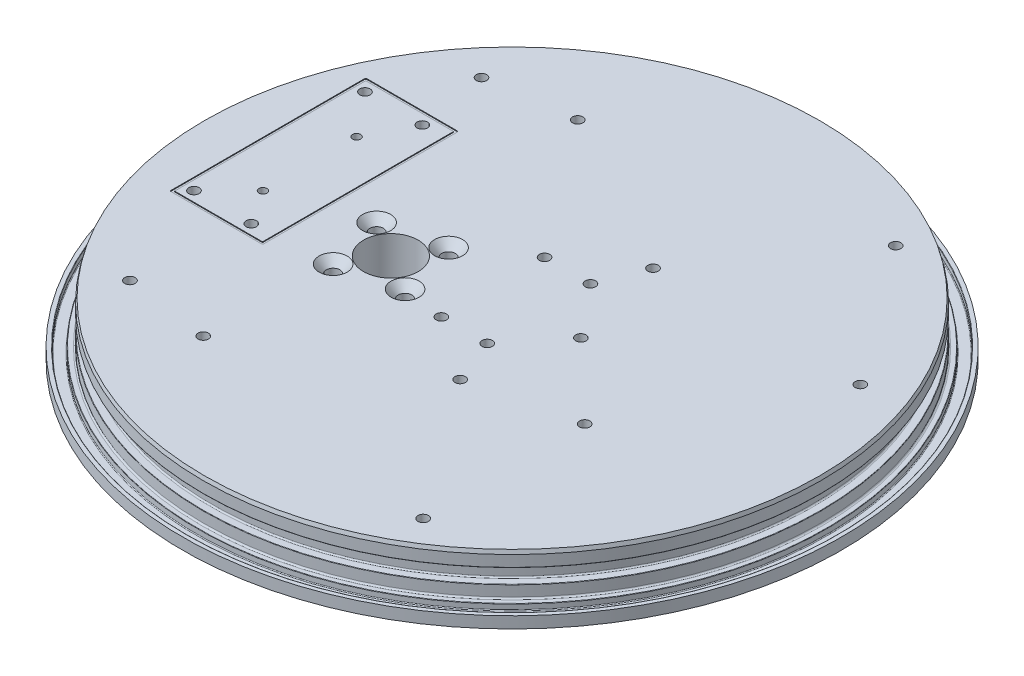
ISO-10303-21;
HEADER;
FILE_DESCRIPTION(('STEP AP214'),'2;1');
FILE_NAME('part.step','',(''),(''),'','','');
FILE_SCHEMA(('AUTOMOTIVE_DESIGN { 1 0 10303 214 1 1 1 1 }'));
ENDSEC;
DATA;
#1=APPLICATION_CONTEXT('core data for automotive mechanical design processes');
#2=APPLICATION_PROTOCOL_DEFINITION('international standard','automotive_design',2000,#1);
#3=PRODUCT_CONTEXT('',#1,'mechanical');
#4=PRODUCT('Part','Part','',(#3));
#5=PRODUCT_RELATED_PRODUCT_CATEGORY('part','',(#4));
#6=PRODUCT_DEFINITION_FORMATION('','',#4);
#7=PRODUCT_DEFINITION_CONTEXT('part definition',#1,'design');
#8=PRODUCT_DEFINITION('design','',#6,#7);
#9=PRODUCT_DEFINITION_SHAPE('','',#8);
#10=(LENGTH_UNIT() NAMED_UNIT(*) SI_UNIT(.MILLI.,.METRE.));
#11=(NAMED_UNIT(*) PLANE_ANGLE_UNIT() SI_UNIT($,.RADIAN.));
#12=(NAMED_UNIT(*) SI_UNIT($,.STERADIAN.) SOLID_ANGLE_UNIT());
#13=UNCERTAINTY_MEASURE_WITH_UNIT(LENGTH_MEASURE(1.E-05),#10,'distance_accuracy_value','');
#14=(GEOMETRIC_REPRESENTATION_CONTEXT(3) GLOBAL_UNCERTAINTY_ASSIGNED_CONTEXT((#13)) GLOBAL_UNIT_ASSIGNED_CONTEXT((#10,
#11,#12)) REPRESENTATION_CONTEXT('',''));
#15=CARTESIAN_POINT('',(0.,0.,0.));
#16=DIRECTION('',(0.,0.,1.));
#17=DIRECTION('',(1.,0.,0.));
#18=AXIS2_PLACEMENT_3D('',#15,#16,#17);
#19=CARTESIAN_POINT('',(-103.0986,0.,0.));
#20=DIRECTION('',(0.,-1.,0.));
#21=DIRECTION('',(0.,0.,-1.));
#22=AXIS2_PLACEMENT_3D('',#19,#20,#21);
#23=PLANE('',#22);
#24=CARTESIAN_POINT('',(0.,0.,0.));
#25=DIRECTION('',(0.,-1.,0.));
#26=DIRECTION('',(0.,0.,-1.));
#27=AXIS2_PLACEMENT_3D('',#24,#25,#26);
#28=CIRCLE('',#27,103.0986);
#29=CARTESIAN_POINT('',(0.,0.,-103.0986));
#30=VERTEX_POINT('',#29);
#31=EDGE_CURVE('E556',#30,#30,#28,.T.);
#32=ORIENTED_EDGE('',*,*,#31,.T.);
#33=EDGE_LOOP('',(#32));
#34=FACE_BOUND('',#33,.T.);
#35=CARTESIAN_POINT('',(0.,0.,0.));
#36=DIRECTION('',(0.,-1.,0.));
#37=DIRECTION('',(0.,0.,-1.));
#38=AXIS2_PLACEMENT_3D('',#35,#36,#37);
#39=CIRCLE('',#38,104.4829);
#40=CARTESIAN_POINT('',(0.,0.,-104.4829));
#41=VERTEX_POINT('',#40);
#42=EDGE_CURVE('E478',#41,#41,#39,.T.);
#43=ORIENTED_EDGE('',*,*,#42,.F.);
#44=EDGE_LOOP('',(#43));
#45=FACE_BOUND('',#44,.T.);
#46=ADVANCED_FACE('F45',(#34,#45),#23,.F.);
#47=CARTESIAN_POINT('',(-109.537499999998,-3.81,0.));
#48=DIRECTION('',(0.,1.,0.));
#49=DIRECTION('',(0.,0.,1.));
#50=AXIS2_PLACEMENT_3D('',#47,#48,#49);
#51=PLANE('',#50);
#52=CARTESIAN_POINT('',(-25.0913312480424,-3.81,-3.99045668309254));
#53=DIRECTION('',(0.,1.,0.));
#54=DIRECTION('',(0.,0.,1.));
#55=AXIS2_PLACEMENT_3D('',#52,#53,#54);
#56=CIRCLE('',#55,2.24789999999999);
#57=CARTESIAN_POINT('',(-25.0913312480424,-3.81,-1.74255668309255));
#58=VERTEX_POINT('',#57);
#59=EDGE_CURVE('E488',#58,#58,#56,.T.);
#60=ORIENTED_EDGE('',*,*,#59,.T.);
#61=EDGE_LOOP('',(#60));
#62=FACE_BOUND('',#61,.T.);
#63=CARTESIAN_POINT('',(-44.2740004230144,-3.81,0.736805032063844));
#64=DIRECTION('',(0.,1.,0.));
#65=DIRECTION('',(0.,0.,1.));
#66=AXIS2_PLACEMENT_3D('',#63,#64,#65);
#67=CIRCLE('',#66,2.2479);
#68=CARTESIAN_POINT('',(-44.2740004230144,-3.81,2.98470503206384));
#69=VERTEX_POINT('',#68);
#70=EDGE_CURVE('E497',#69,#69,#67,.T.);
#71=ORIENTED_EDGE('',*,*,#70,.T.);
#72=EDGE_LOOP('',(#71));
#73=FACE_BOUND('',#72,.T.);
#74=CARTESIAN_POINT('',(-39.546738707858,-3.81,19.9194742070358));
#75=DIRECTION('',(0.,1.,0.));
#76=DIRECTION('',(0.,0.,1.));
#77=AXIS2_PLACEMENT_3D('',#74,#75,#76);
#78=CIRCLE('',#77,2.2479);
#79=CARTESIAN_POINT('',(-39.546738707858,-3.81,22.1673742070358));
#80=VERTEX_POINT('',#79);
#81=EDGE_CURVE('E506',#80,#80,#78,.T.);
#82=ORIENTED_EDGE('',*,*,#81,.T.);
#83=EDGE_LOOP('',(#82));
#84=FACE_BOUND('',#83,.T.);
#85=CARTESIAN_POINT('',(-20.364069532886,-3.81,15.1922124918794));
#86=DIRECTION('',(0.,1.,0.));
#87=DIRECTION('',(0.,0.,1.));
#88=AXIS2_PLACEMENT_3D('',#85,#86,#87);
#89=CIRCLE('',#88,2.24789999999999);
#90=CARTESIAN_POINT('',(-20.364069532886,-3.81,17.4401124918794));
#91=VERTEX_POINT('',#90);
#92=EDGE_CURVE('E515',#91,#91,#89,.T.);
#93=ORIENTED_EDGE('',*,*,#92,.T.);
#94=EDGE_LOOP('',(#93));
#95=FACE_BOUND('',#94,.T.);
#96=CARTESIAN_POINT('',(-32.3190349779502,-3.81,7.96450876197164));
#97=DIRECTION('',(0.,1.,0.));
#98=DIRECTION('',(-1.,0.,0.));
#99=AXIS2_PLACEMENT_3D('',#96,#97,#98);
#100=CIRCLE('',#99,9.08050000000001);
#101=CARTESIAN_POINT('',(-41.3995349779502,-3.81,7.96450876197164));
#102=VERTEX_POINT('',#101);
#103=EDGE_CURVE('E543',#102,#102,#100,.T.);
#104=ORIENTED_EDGE('',*,*,#103,.T.);
#105=EDGE_LOOP('',(#104));
#106=FACE_BOUND('',#105,.T.);
#107=CARTESIAN_POINT('',(-32.3190349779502,-3.81,7.96450876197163));
#108=DIRECTION('',(0.,1.,0.));
#109=DIRECTION('',(-1.,0.,0.));
#110=AXIS2_PLACEMENT_3D('',#107,#108,#109);
#111=CIRCLE('',#110,18.7198);
#112=CARTESIAN_POINT('',(-51.0388349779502,-3.81000000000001,7.96450876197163));
#113=VERTEX_POINT('',#112);
#114=EDGE_CURVE('E518',#113,#113,#111,.T.);
#115=ORIENTED_EDGE('',*,*,#114,.F.);
#116=EDGE_LOOP('',(#115));
#117=FACE_BOUND('',#116,.T.);
#118=ADVANCED_FACE('F607',(#62,#73,#84,#95,#106,#117),#51,.F.);
#119=CARTESIAN_POINT('',(0.,13.97,0.));
#120=DIRECTION('',(0.,-1.,0.));
#121=DIRECTION('',(0.,0.,-1.));
#122=AXIS2_PLACEMENT_3D('',#119,#120,#121);
#123=PLANE('',#122);
#124=DIRECTION('',(0.,0.,-1.));
#125=VECTOR('',#124,1.);
#126=CARTESIAN_POINT('',(-56.9037499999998,13.97,25.6063749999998));
#127=LINE('',#126,#125);
#128=CARTESIAN_POINT('',(-56.9037499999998,13.97,25.6063749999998));
#129=VERTEX_POINT('',#128);
#130=CARTESIAN_POINT('',(-56.9037499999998,13.97,-38.6556250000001));
#131=VERTEX_POINT('',#130);
#132=EDGE_CURVE('E281',#129,#131,#127,.T.);
#133=ORIENTED_EDGE('',*,*,#132,.F.);
#134=CARTESIAN_POINT('',(-57.3006249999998,13.97,25.6063749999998));
#135=DIRECTION('',(0.,1.,0.));
#136=DIRECTION('',(0.,0.,1.));
#137=AXIS2_PLACEMENT_3D('',#134,#135,#136);
#138=CIRCLE('',#137,0.396875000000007);
#139=CARTESIAN_POINT('',(-57.3006249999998,13.97,26.0032499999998));
#140=VERTEX_POINT('',#139);
#141=EDGE_CURVE('E61',#140,#129,#138,.T.);
#142=ORIENTED_EDGE('',*,*,#141,.F.);
#143=DIRECTION('',(1.,0.,0.));
#144=VECTOR('',#143,1.);
#145=CARTESIAN_POINT('',(-87.3043749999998,13.97,26.0032499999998));
#146=LINE('',#145,#144);
#147=CARTESIAN_POINT('',(-87.3043749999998,13.97,26.0032499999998));
#148=VERTEX_POINT('',#147);
#149=EDGE_CURVE('E255',#148,#140,#146,.T.);
#150=ORIENTED_EDGE('',*,*,#149,.F.);
#151=CARTESIAN_POINT('',(-87.3043749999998,13.97,25.6063749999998));
#152=DIRECTION('',(0.,1.,0.));
#153=DIRECTION('',(0.,0.,1.));
#154=AXIS2_PLACEMENT_3D('',#151,#152,#153);
#155=CIRCLE('',#154,0.396875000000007);
#156=CARTESIAN_POINT('',(-87.7012499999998,13.97,25.6063749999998));
#157=VERTEX_POINT('',#156);
#158=EDGE_CURVE('E299',#157,#148,#155,.T.);
#159=ORIENTED_EDGE('',*,*,#158,.F.);
#160=DIRECTION('',(0.,0.,1.));
#161=VECTOR('',#160,1.);
#162=CARTESIAN_POINT('',(-87.7012499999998,13.97,-38.6556250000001));
#163=LINE('',#162,#161);
#164=CARTESIAN_POINT('',(-87.7012499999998,13.97,-38.6556250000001));
#165=VERTEX_POINT('',#164);
#166=EDGE_CURVE('E295',#165,#157,#163,.T.);
#167=ORIENTED_EDGE('',*,*,#166,.F.);
#168=CARTESIAN_POINT('',(-87.3043749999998,13.97,-38.6556250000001));
#169=DIRECTION('',(0.,1.,0.));
#170=DIRECTION('',(0.,0.,-1.));
#171=AXIS2_PLACEMENT_3D('',#168,#169,#170);
#172=CIRCLE('',#171,0.396874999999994);
#173=CARTESIAN_POINT('',(-87.3043749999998,13.97,-39.0525000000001));
#174=VERTEX_POINT('',#173);
#175=EDGE_CURVE('E291',#174,#165,#172,.T.);
#176=ORIENTED_EDGE('',*,*,#175,.F.);
#177=DIRECTION('',(-1.,0.,0.));
#178=VECTOR('',#177,1.);
#179=CARTESIAN_POINT('',(-57.3006249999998,13.97,-39.0525000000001));
#180=LINE('',#179,#178);
#181=CARTESIAN_POINT('',(-57.3006249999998,13.97,-39.0525000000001));
#182=VERTEX_POINT('',#181);
#183=EDGE_CURVE('E287',#182,#174,#180,.T.);
#184=ORIENTED_EDGE('',*,*,#183,.F.);
#185=CARTESIAN_POINT('',(-57.3006249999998,13.97,-38.6556250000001));
#186=DIRECTION('',(0.,1.,0.));
#187=DIRECTION('',(0.,0.,-1.));
#188=AXIS2_PLACEMENT_3D('',#185,#186,#187);
#189=CIRCLE('',#188,0.396874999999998);
#190=EDGE_CURVE('E284',#131,#182,#189,.T.);
#191=ORIENTED_EDGE('',*,*,#190,.F.);
#192=EDGE_LOOP('',(#133,#142,#150,#159,#167,#176,#184,#191));
#193=FACE_BOUND('',#192,.T.);
#194=CARTESIAN_POINT('',(22.8600000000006,13.97,0.));
#195=DIRECTION('',(0.,1.,0.));
#196=DIRECTION('',(0.,0.,1.));
#197=AXIS2_PLACEMENT_3D('',#194,#195,#196);
#198=CIRCLE('',#197,1.72719999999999);
#199=CARTESIAN_POINT('',(22.8600000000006,13.97,1.72720000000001));
#200=VERTEX_POINT('',#199);
#201=EDGE_CURVE('E359',#200,#200,#198,.T.);
#202=ORIENTED_EDGE('',*,*,#201,.F.);
#203=EDGE_LOOP('',(#202));
#204=FACE_BOUND('',#203,.T.);
#205=CARTESIAN_POINT('',(-6.35,13.97,-17.15135));
#206=DIRECTION('',(0.,1.,0.));
#207=DIRECTION('',(0.,0.,1.));
#208=AXIS2_PLACEMENT_3D('',#205,#206,#207);
#209=CIRCLE('',#208,1.72719999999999);
#210=CARTESIAN_POINT('',(-6.35,13.97,-15.42415));
#211=VERTEX_POINT('',#210);
#212=EDGE_CURVE('E365',#211,#211,#209,.T.);
#213=ORIENTED_EDGE('',*,*,#212,.F.);
#214=EDGE_LOOP('',(#213));
#215=FACE_BOUND('',#214,.T.);
#216=CARTESIAN_POINT('',(-6.35,13.97,17.15135));
#217=DIRECTION('',(0.,1.,0.));
#218=DIRECTION('',(0.,0.,1.));
#219=AXIS2_PLACEMENT_3D('',#216,#217,#218);
#220=CIRCLE('',#219,1.72719999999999);
#221=CARTESIAN_POINT('',(-6.35,13.97,18.87855));
#222=VERTEX_POINT('',#221);
#223=EDGE_CURVE('E371',#222,#222,#220,.T.);
#224=ORIENTED_EDGE('',*,*,#223,.F.);
#225=EDGE_LOOP('',(#224));
#226=FACE_BOUND('',#225,.T.);
#227=CARTESIAN_POINT('',(8.89,13.97,-17.15135));
#228=DIRECTION('',(0.,1.,0.));
#229=DIRECTION('',(0.,0.,1.));
#230=AXIS2_PLACEMENT_3D('',#227,#228,#229);
#231=CIRCLE('',#230,1.72719999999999);
#232=CARTESIAN_POINT('',(8.89,13.97,-15.42415));
#233=VERTEX_POINT('',#232);
#234=EDGE_CURVE('E377',#233,#233,#231,.T.);
#235=ORIENTED_EDGE('',*,*,#234,.F.);
#236=EDGE_LOOP('',(#235));
#237=FACE_BOUND('',#236,.T.);
#238=CARTESIAN_POINT('',(8.89,13.97,17.15135));
#239=DIRECTION('',(0.,1.,0.));
#240=DIRECTION('',(0.,0.,1.));
#241=AXIS2_PLACEMENT_3D('',#238,#239,#240);
#242=CIRCLE('',#241,1.72719999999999);
#243=CARTESIAN_POINT('',(8.89,13.97,18.87855));
#244=VERTEX_POINT('',#243);
#245=EDGE_CURVE('E383',#244,#244,#242,.T.);
#246=ORIENTED_EDGE('',*,*,#245,.F.);
#247=EDGE_LOOP('',(#246));
#248=FACE_BOUND('',#247,.T.);
#249=CARTESIAN_POINT('',(48.641,13.97,78.1668660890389));
#250=DIRECTION('',(0.,1.,0.));
#251=DIRECTION('',(0.,0.,1.));
#252=AXIS2_PLACEMENT_3D('',#249,#250,#251);
#253=CIRCLE('',#252,1.72719999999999);
#254=CARTESIAN_POINT('',(48.641,13.97,79.8940660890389));
#255=VERTEX_POINT('',#254);
#256=EDGE_CURVE('E389',#255,#255,#253,.T.);
#257=ORIENTED_EDGE('',*,*,#256,.F.);
#258=EDGE_LOOP('',(#257));
#259=FACE_BOUND('',#258,.T.);
#260=CARTESIAN_POINT('',(48.2691625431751,13.97,24.13));
#261=DIRECTION('',(0.,1.,0.));
#262=DIRECTION('',(0.,0.,1.));
#263=AXIS2_PLACEMENT_3D('',#260,#261,#262);
#264=CIRCLE('',#263,1.72719999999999);
#265=CARTESIAN_POINT('',(48.2691625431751,13.97,25.8572));
#266=VERTEX_POINT('',#265);
#267=EDGE_CURVE('E395',#266,#266,#264,.T.);
#268=ORIENTED_EDGE('',*,*,#267,.F.);
#269=EDGE_LOOP('',(#268));
#270=FACE_BOUND('',#269,.T.);
#271=CARTESIAN_POINT('',(-40.4113693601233,13.97,62.23));
#272=DIRECTION('',(0.,1.,0.));
#273=DIRECTION('',(0.,0.,1.));
#274=AXIS2_PLACEMENT_3D('',#271,#272,#273);
#275=CIRCLE('',#274,1.72719999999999);
#276=CARTESIAN_POINT('',(-40.4113693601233,13.97,63.9572));
#277=VERTEX_POINT('',#276);
#278=EDGE_CURVE('E401',#277,#277,#275,.T.);
#279=ORIENTED_EDGE('',*,*,#278,.F.);
#280=EDGE_LOOP('',(#279));
#281=FACE_BOUND('',#280,.T.);
#282=CARTESIAN_POINT('',(82.7428466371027,13.97,-33.02));
#283=DIRECTION('',(0.,1.,0.));
#284=DIRECTION('',(0.,0.,1.));
#285=AXIS2_PLACEMENT_3D('',#282,#283,#284);
#286=CIRCLE('',#285,1.72719999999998);
#287=CARTESIAN_POINT('',(82.7428466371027,13.97,-31.2928));
#288=VERTEX_POINT('',#287);
#289=EDGE_CURVE('E407',#288,#288,#286,.T.);
#290=ORIENTED_EDGE('',*,*,#289,.F.);
#291=EDGE_LOOP('',(#290));
#292=FACE_BOUND('',#291,.T.);
#293=CARTESIAN_POINT('',(48.641,13.97,-78.8619371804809));
#294=DIRECTION('',(0.,1.,0.));
#295=DIRECTION('',(0.,0.,1.));
#296=AXIS2_PLACEMENT_3D('',#293,#294,#295);
#297=CIRCLE('',#296,1.72719999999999);
#298=CARTESIAN_POINT('',(48.641,13.97,-77.1347371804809));
#299=VERTEX_POINT('',#298);
#300=EDGE_CURVE('E413',#299,#299,#297,.T.);
#301=ORIENTED_EDGE('',*,*,#300,.F.);
#302=EDGE_LOOP('',(#301));
#303=FACE_BOUND('',#302,.T.);
#304=CARTESIAN_POINT('',(-40.4113693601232,13.97,-62.23));
#305=DIRECTION('',(0.,1.,0.));
#306=DIRECTION('',(0.,0.,1.));
#307=AXIS2_PLACEMENT_3D('',#304,#305,#306);
#308=CIRCLE('',#307,1.72719999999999);
#309=CARTESIAN_POINT('',(-40.4113693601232,13.97,-60.5028));
#310=VERTEX_POINT('',#309);
#311=EDGE_CURVE('E419',#310,#310,#308,.T.);
#312=ORIENTED_EDGE('',*,*,#311,.F.);
#313=EDGE_LOOP('',(#312));
#314=FACE_BOUND('',#313,.T.);
#315=CARTESIAN_POINT('',(14.7983753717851,13.97,32.0523711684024));
#316=DIRECTION('',(0.,1.,0.));
#317=DIRECTION('',(0.,0.,1.));
#318=AXIS2_PLACEMENT_3D('',#315,#316,#317);
#319=CIRCLE('',#318,1.72719999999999);
#320=CARTESIAN_POINT('',(14.7983753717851,13.97,33.7795711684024));
#321=VERTEX_POINT('',#320);
#322=EDGE_CURVE('E426',#321,#321,#319,.T.);
#323=ORIENTED_EDGE('',*,*,#322,.F.);
#324=EDGE_LOOP('',(#323));
#325=FACE_BOUND('',#324,.T.);
#326=CARTESIAN_POINT('',(-68.58,13.97,58.42));
#327=DIRECTION('',(0.,1.,0.));
#328=DIRECTION('',(0.,0.,1.));
#329=AXIS2_PLACEMENT_3D('',#326,#327,#328);
#330=CIRCLE('',#329,1.72719999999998);
#331=CARTESIAN_POINT('',(-68.58,13.97,60.1472));
#332=VERTEX_POINT('',#331);
#333=EDGE_CURVE('E432',#332,#332,#330,.T.);
#334=ORIENTED_EDGE('',*,*,#333,.F.);
#335=EDGE_LOOP('',(#334));
#336=FACE_BOUND('',#335,.T.);
#337=CARTESIAN_POINT('',(-68.58,13.97,-58.42));
#338=DIRECTION('',(0.,1.,0.));
#339=DIRECTION('',(0.,0.,1.));
#340=AXIS2_PLACEMENT_3D('',#337,#338,#339);
#341=CIRCLE('',#340,1.72719999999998);
#342=CARTESIAN_POINT('',(-68.58,13.97,-56.6928));
#343=VERTEX_POINT('',#342);
#344=EDGE_CURVE('E438',#343,#343,#341,.T.);
#345=ORIENTED_EDGE('',*,*,#344,.F.);
#346=EDGE_LOOP('',(#345));
#347=FACE_BOUND('',#346,.T.);
#348=CARTESIAN_POINT('',(14.7983753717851,13.97,-32.0523711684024));
#349=DIRECTION('',(0.,1.,0.));
#350=DIRECTION('',(0.,0.,1.));
#351=AXIS2_PLACEMENT_3D('',#348,#349,#350);
#352=CIRCLE('',#351,1.72719999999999);
#353=CARTESIAN_POINT('',(14.7983753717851,13.97,-30.3251711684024));
#354=VERTEX_POINT('',#353);
#355=EDGE_CURVE('E444',#354,#354,#352,.T.);
#356=ORIENTED_EDGE('',*,*,#355,.F.);
#357=EDGE_LOOP('',(#356));
#358=FACE_BOUND('',#357,.T.);
#359=CARTESIAN_POINT('',(-25.0913312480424,13.97,-3.99045668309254));
#360=DIRECTION('',(0.,1.,0.));
#361=DIRECTION('',(0.,0.,1.));
#362=AXIS2_PLACEMENT_3D('',#359,#360,#361);
#363=CIRCLE('',#362,4.6579917);
#364=CARTESIAN_POINT('',(-25.0913312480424,13.97,0.667535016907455));
#365=VERTEX_POINT('',#364);
#366=EDGE_CURVE('E482',#365,#365,#363,.T.);
#367=ORIENTED_EDGE('',*,*,#366,.F.);
#368=EDGE_LOOP('',(#367));
#369=FACE_BOUND('',#368,.T.);
#370=CARTESIAN_POINT('',(-44.2740004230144,13.97,0.736805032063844));
#371=DIRECTION('',(0.,1.,0.));
#372=DIRECTION('',(0.,0.,1.));
#373=AXIS2_PLACEMENT_3D('',#370,#371,#372);
#374=CIRCLE('',#373,4.6579917);
#375=CARTESIAN_POINT('',(-44.2740004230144,13.97,5.39479673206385));
#376=VERTEX_POINT('',#375);
#377=EDGE_CURVE('E491',#376,#376,#374,.T.);
#378=ORIENTED_EDGE('',*,*,#377,.F.);
#379=EDGE_LOOP('',(#378));
#380=FACE_BOUND('',#379,.T.);
#381=CARTESIAN_POINT('',(-39.546738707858,13.97,19.9194742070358));
#382=DIRECTION('',(0.,1.,0.));
#383=DIRECTION('',(0.,0.,1.));
#384=AXIS2_PLACEMENT_3D('',#381,#382,#383);
#385=CIRCLE('',#384,4.6579917);
#386=CARTESIAN_POINT('',(-39.546738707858,13.97,24.5774659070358));
#387=VERTEX_POINT('',#386);
#388=EDGE_CURVE('E500',#387,#387,#385,.T.);
#389=ORIENTED_EDGE('',*,*,#388,.F.);
#390=EDGE_LOOP('',(#389));
#391=FACE_BOUND('',#390,.T.);
#392=CARTESIAN_POINT('',(-20.364069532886,13.97,15.1922124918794));
#393=DIRECTION('',(0.,1.,0.));
#394=DIRECTION('',(0.,0.,1.));
#395=AXIS2_PLACEMENT_3D('',#392,#393,#394);
#396=CIRCLE('',#395,4.6579917);
#397=CARTESIAN_POINT('',(-20.364069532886,13.97,19.8502041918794));
#398=VERTEX_POINT('',#397);
#399=EDGE_CURVE('E509',#398,#398,#396,.T.);
#400=ORIENTED_EDGE('',*,*,#399,.F.);
#401=EDGE_LOOP('',(#400));
#402=FACE_BOUND('',#401,.T.);
#403=CARTESIAN_POINT('',(-32.3190349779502,13.97,7.96450876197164));
#404=DIRECTION('',(0.,1.,0.));
#405=DIRECTION('',(-1.,0.,0.));
#406=AXIS2_PLACEMENT_3D('',#403,#404,#405);
#407=CIRCLE('',#406,9.08050000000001);
#408=CARTESIAN_POINT('',(-41.3995349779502,13.97,7.96450876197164));
#409=VERTEX_POINT('',#408);
#410=EDGE_CURVE('E542',#409,#409,#407,.T.);
#411=ORIENTED_EDGE('',*,*,#410,.F.);
#412=EDGE_LOOP('',(#411));
#413=FACE_BOUND('',#412,.T.);
#414=CARTESIAN_POINT('',(0.,13.97,0.));
#415=DIRECTION('',(0.,-1.,0.));
#416=DIRECTION('',(0.,0.,-1.));
#417=AXIS2_PLACEMENT_3D('',#414,#415,#416);
#418=CIRCLE('',#417,102.250304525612);
#419=CARTESIAN_POINT('',(0.,13.97,-102.250304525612));
#420=VERTEX_POINT('',#419);
#421=EDGE_CURVE('E11',#420,#420,#418,.T.);
#422=ORIENTED_EDGE('',*,*,#421,.F.);
#423=EDGE_LOOP('',(#422));
#424=FACE_BOUND('',#423,.T.);
#425=ADVANCED_FACE('F47',(#193,#204,#215,#226,#237,#248,#259,#270,#281,#292,#303,#314,#325,#336,
#347,#358,#369,#380,#391,#402,#413,#424),#123,.F.);
#426=CARTESIAN_POINT('',(0.,13.97,0.));
#427=DIRECTION('',(0.,-1.,0.));
#428=DIRECTION('',(0.,0.,-1.));
#429=AXIS2_PLACEMENT_3D('',#426,#427,#428);
#430=CONICAL_SURFACE('',#429,102.250304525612,0.261799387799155);
#431=CARTESIAN_POINT('',(0.,12.7,0.));
#432=DIRECTION('',(0.,-1.,0.));
#433=DIRECTION('',(0.,0.,-1.));
#434=AXIS2_PLACEMENT_3D('',#431,#432,#433);
#435=CIRCLE('',#434,102.5906);
#436=CARTESIAN_POINT('',(0.,12.7,-102.5906));
#437=VERTEX_POINT('',#436);
#438=EDGE_CURVE('E54',#437,#437,#435,.T.);
#439=ORIENTED_EDGE('',*,*,#438,.F.);
#440=EDGE_LOOP('',(#439));
#441=FACE_BOUND('',#440,.T.);
#442=ORIENTED_EDGE('',*,*,#421,.T.);
#443=EDGE_LOOP('',(#442));
#444=FACE_BOUND('',#443,.T.);
#445=ADVANCED_FACE('F601',(#441,#444),#430,.T.);
#446=CARTESIAN_POINT('',(0.,13.97,0.));
#447=DIRECTION('',(0.,-1.,0.));
#448=DIRECTION('',(0.,0.,-1.));
#449=AXIS2_PLACEMENT_3D('',#446,#447,#448);
#450=CYLINDRICAL_SURFACE('',#449,102.5906);
#451=CARTESIAN_POINT('',(0.,9.01699999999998,0.));
#452=DIRECTION('',(0.,-1.,0.));
#453=DIRECTION('',(0.,0.,-1.));
#454=AXIS2_PLACEMENT_3D('',#451,#452,#453);
#455=CIRCLE('',#454,102.5906);
#456=CARTESIAN_POINT('',(0.,9.01699999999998,-102.5906));
#457=VERTEX_POINT('',#456);
#458=EDGE_CURVE('E592',#457,#457,#455,.T.);
#459=ORIENTED_EDGE('',*,*,#458,.F.);
#460=EDGE_LOOP('',(#459));
#461=FACE_BOUND('',#460,.T.);
#462=ORIENTED_EDGE('',*,*,#438,.T.);
#463=EDGE_LOOP('',(#462));
#464=FACE_BOUND('',#463,.T.);
#465=ADVANCED_FACE('F599',(#461,#464),#450,.T.);
#466=CARTESIAN_POINT('',(0.,9.01699999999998,0.));
#467=DIRECTION('',(0.,-1.,0.));
#468=DIRECTION('',(0.,0.,-1.));
#469=AXIS2_PLACEMENT_3D('',#466,#467,#468);
#470=TOROIDAL_SURFACE('',#469,102.4636,0.127);
#471=CARTESIAN_POINT('',(0.,8.88999999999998,0.));
#472=DIRECTION('',(0.,-1.,0.));
#473=DIRECTION('',(0.,0.,-1.));
#474=AXIS2_PLACEMENT_3D('',#471,#472,#473);
#475=CIRCLE('',#474,102.4636);
#476=CARTESIAN_POINT('',(0.,8.88999999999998,-102.4636));
#477=VERTEX_POINT('',#476);
#478=EDGE_CURVE('E588',#477,#477,#475,.T.);
#479=ORIENTED_EDGE('',*,*,#478,.F.);
#480=EDGE_LOOP('',(#479));
#481=FACE_BOUND('',#480,.T.);
#482=ORIENTED_EDGE('',*,*,#458,.T.);
#483=EDGE_LOOP('',(#482));
#484=FACE_BOUND('',#483,.T.);
#485=ADVANCED_FACE('F1509',(#481,#484),#470,.T.);
#486=CARTESIAN_POINT('',(-102.4636,8.88999999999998,0.));
#487=DIRECTION('',(0.,1.,0.));
#488=DIRECTION('',(0.,0.,1.));
#489=AXIS2_PLACEMENT_3D('',#486,#487,#488);
#490=PLANE('',#489);
#491=CARTESIAN_POINT('',(0.,8.88999999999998,0.));
#492=DIRECTION('',(0.,-1.,0.));
#493=DIRECTION('',(0.,0.,-1.));
#494=AXIS2_PLACEMENT_3D('',#491,#492,#493);
#495=CIRCLE('',#494,100.2157);
#496=CARTESIAN_POINT('',(0.,8.88999999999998,-100.2157));
#497=VERTEX_POINT('',#496);
#498=EDGE_CURVE('E584',#497,#497,#495,.T.);
#499=ORIENTED_EDGE('',*,*,#498,.F.);
#500=EDGE_LOOP('',(#499));
#501=FACE_BOUND('',#500,.T.);
#502=ORIENTED_EDGE('',*,*,#478,.T.);
#503=EDGE_LOOP('',(#502));
#504=FACE_BOUND('',#503,.T.);
#505=ADVANCED_FACE('F1521',(#501,#504),#490,.F.);
#506=CARTESIAN_POINT('',(0.,8.44549999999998,0.));
#507=DIRECTION('',(0.,-1.,0.));
#508=DIRECTION('',(0.,0.,-1.));
#509=AXIS2_PLACEMENT_3D('',#506,#507,#508);
#510=TOROIDAL_SURFACE('',#509,100.2157,0.4445);
#511=CARTESIAN_POINT('',(0.,8.44549999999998,0.));
#512=DIRECTION('',(0.,-1.,0.));
#513=DIRECTION('',(0.,0.,-1.));
#514=AXIS2_PLACEMENT_3D('',#511,#512,#513);
#515=CIRCLE('',#514,99.7712);
#516=CARTESIAN_POINT('',(0.,8.44549999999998,-99.7712));
#517=VERTEX_POINT('',#516);
#518=EDGE_CURVE('E580',#517,#517,#515,.T.);
#519=ORIENTED_EDGE('',*,*,#518,.F.);
#520=EDGE_LOOP('',(#519));
#521=FACE_BOUND('',#520,.T.);
#522=ORIENTED_EDGE('',*,*,#498,.T.);
#523=EDGE_LOOP('',(#522));
#524=FACE_BOUND('',#523,.T.);
#525=ADVANCED_FACE('F1529',(#521,#524),#510,.F.);
#526=CARTESIAN_POINT('',(0.,13.97,0.));
#527=DIRECTION('',(0.,-1.,0.));
#528=DIRECTION('',(0.,0.,-1.));
#529=AXIS2_PLACEMENT_3D('',#526,#527,#528);
#530=CYLINDRICAL_SURFACE('',#529,99.7712);
#531=CARTESIAN_POINT('',(0.,4.52119999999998,0.));
#532=DIRECTION('',(0.,-1.,0.));
#533=DIRECTION('',(0.,0.,-1.));
#534=AXIS2_PLACEMENT_3D('',#531,#532,#533);
#535=CIRCLE('',#534,99.7712);
#536=CARTESIAN_POINT('',(0.,4.52119999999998,-99.7712));
#537=VERTEX_POINT('',#536);
#538=EDGE_CURVE('E576',#537,#537,#535,.T.);
#539=ORIENTED_EDGE('',*,*,#538,.F.);
#540=EDGE_LOOP('',(#539));
#541=FACE_BOUND('',#540,.T.);
#542=ORIENTED_EDGE('',*,*,#518,.T.);
#543=EDGE_LOOP('',(#542));
#544=FACE_BOUND('',#543,.T.);
#545=ADVANCED_FACE('F1537',(#541,#544),#530,.T.);
#546=CARTESIAN_POINT('',(0.,4.52119999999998,0.));
#547=DIRECTION('',(0.,-1.,0.));
#548=DIRECTION('',(0.,0.,-1.));
#549=AXIS2_PLACEMENT_3D('',#546,#547,#548);
#550=TOROIDAL_SURFACE('',#549,100.2157,0.4445);
#551=CARTESIAN_POINT('',(0.,4.07669999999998,0.));
#552=DIRECTION('',(0.,-1.,0.));
#553=DIRECTION('',(0.,0.,-1.));
#554=AXIS2_PLACEMENT_3D('',#551,#552,#553);
#555=CIRCLE('',#554,100.2157);
#556=CARTESIAN_POINT('',(0.,4.07669999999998,-100.2157));
#557=VERTEX_POINT('',#556);
#558=EDGE_CURVE('E572',#557,#557,#555,.T.);
#559=ORIENTED_EDGE('',*,*,#558,.F.);
#560=EDGE_LOOP('',(#559));
#561=FACE_BOUND('',#560,.T.);
#562=ORIENTED_EDGE('',*,*,#538,.T.);
#563=EDGE_LOOP('',(#562));
#564=FACE_BOUND('',#563,.T.);
#565=ADVANCED_FACE('F1545',(#561,#564),#550,.F.);
#566=CARTESIAN_POINT('',(-102.4636,4.07669999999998,0.));
#567=DIRECTION('',(0.,-1.,0.));
#568=DIRECTION('',(0.,0.,-1.));
#569=AXIS2_PLACEMENT_3D('',#566,#567,#568);
#570=PLANE('',#569);
#571=CARTESIAN_POINT('',(0.,4.07669999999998,0.));
#572=DIRECTION('',(0.,-1.,0.));
#573=DIRECTION('',(0.,0.,-1.));
#574=AXIS2_PLACEMENT_3D('',#571,#572,#573);
#575=CIRCLE('',#574,102.4636);
#576=CARTESIAN_POINT('',(0.,4.07669999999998,-102.4636));
#577=VERTEX_POINT('',#576);
#578=EDGE_CURVE('E568',#577,#577,#575,.T.);
#579=ORIENTED_EDGE('',*,*,#578,.F.);
#580=EDGE_LOOP('',(#579));
#581=FACE_BOUND('',#580,.T.);
#582=ORIENTED_EDGE('',*,*,#558,.T.);
#583=EDGE_LOOP('',(#582));
#584=FACE_BOUND('',#583,.T.);
#585=ADVANCED_FACE('F1553',(#581,#584),#570,.F.);
#586=CARTESIAN_POINT('',(0.,3.94969999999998,0.));
#587=DIRECTION('',(0.,-1.,0.));
#588=DIRECTION('',(0.,0.,-1.));
#589=AXIS2_PLACEMENT_3D('',#586,#587,#588);
#590=TOROIDAL_SURFACE('',#589,102.4636,0.127);
#591=CARTESIAN_POINT('',(0.,3.94969999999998,0.));
#592=DIRECTION('',(0.,-1.,0.));
#593=DIRECTION('',(0.,0.,-1.));
#594=AXIS2_PLACEMENT_3D('',#591,#592,#593);
#595=CIRCLE('',#594,102.5906);
#596=CARTESIAN_POINT('',(0.,3.94969999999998,-102.5906));
#597=VERTEX_POINT('',#596);
#598=EDGE_CURVE('E564',#597,#597,#595,.T.);
#599=ORIENTED_EDGE('',*,*,#598,.F.);
#600=EDGE_LOOP('',(#599));
#601=FACE_BOUND('',#600,.T.);
#602=ORIENTED_EDGE('',*,*,#578,.T.);
#603=EDGE_LOOP('',(#602));
#604=FACE_BOUND('',#603,.T.);
#605=ADVANCED_FACE('F1561',(#601,#604),#590,.T.);
#606=CARTESIAN_POINT('',(0.,13.97,0.));
#607=DIRECTION('',(0.,-1.,0.));
#608=DIRECTION('',(0.,0.,-1.));
#609=AXIS2_PLACEMENT_3D('',#606,#607,#608);
#610=CYLINDRICAL_SURFACE('',#609,102.5906);
#611=CARTESIAN_POINT('',(0.,0.508000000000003,0.));
#612=DIRECTION('',(0.,-1.,0.));
#613=DIRECTION('',(0.,0.,-1.));
#614=AXIS2_PLACEMENT_3D('',#611,#612,#613);
#615=CIRCLE('',#614,102.5906);
#616=CARTESIAN_POINT('',(0.,0.508000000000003,-102.5906));
#617=VERTEX_POINT('',#616);
#618=EDGE_CURVE('E560',#617,#617,#615,.T.);
#619=ORIENTED_EDGE('',*,*,#618,.F.);
#620=EDGE_LOOP('',(#619));
#621=FACE_BOUND('',#620,.T.);
#622=ORIENTED_EDGE('',*,*,#598,.T.);
#623=EDGE_LOOP('',(#622));
#624=FACE_BOUND('',#623,.T.);
#625=ADVANCED_FACE('F639',(#621,#624),#610,.T.);
#626=CARTESIAN_POINT('',(0.,0.508,0.));
#627=DIRECTION('',(0.,-1.,0.));
#628=DIRECTION('',(0.,0.,-1.));
#629=AXIS2_PLACEMENT_3D('',#626,#627,#628);
#630=TOROIDAL_SURFACE('',#629,103.0986,0.507999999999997);
#631=ORIENTED_EDGE('',*,*,#31,.F.);
#632=EDGE_LOOP('',(#631));
#633=FACE_BOUND('',#632,.T.);
#634=ORIENTED_EDGE('',*,*,#618,.T.);
#635=EDGE_LOOP('',(#634));
#636=FACE_BOUND('',#635,.T.);
#637=ADVANCED_FACE('F632',(#633,#636),#630,.F.);
#638=CARTESIAN_POINT('',(0.,0.,0.));
#639=DIRECTION('',(0.,-1.,0.));
#640=DIRECTION('',(0.,0.,-1.));
#641=AXIS2_PLACEMENT_3D('',#638,#639,#640);
#642=CIRCLE('',#641,108.2675);
#643=CARTESIAN_POINT('',(0.,0.,-108.2675));
#644=VERTEX_POINT('',#643);
#645=EDGE_CURVE('E474',#644,#644,#642,.T.);
#646=ORIENTED_EDGE('',*,*,#645,.T.);
#647=EDGE_LOOP('',(#646));
#648=FACE_BOUND('',#647,.T.);
#649=CARTESIAN_POINT('',(0.,0.,0.));
#650=DIRECTION('',(0.,-1.,0.));
#651=DIRECTION('',(0.,0.,-1.));
#652=AXIS2_PLACEMENT_3D('',#649,#650,#651);
#653=CIRCLE('',#652,109.537499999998);
#654=CARTESIAN_POINT('',(0.,0.,-109.537499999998));
#655=VERTEX_POINT('',#654);
#656=EDGE_CURVE('E552',#655,#655,#653,.T.);
#657=ORIENTED_EDGE('',*,*,#656,.F.);
#658=EDGE_LOOP('',(#657));
#659=FACE_BOUND('',#658,.T.);
#660=ADVANCED_FACE('F624',(#648,#659),#23,.F.);
#661=CARTESIAN_POINT('',(0.,13.97,0.));
#662=DIRECTION('',(0.,-1.,0.));
#663=DIRECTION('',(0.,0.,-1.));
#664=AXIS2_PLACEMENT_3D('',#661,#662,#663);
#665=CYLINDRICAL_SURFACE('',#664,109.537499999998);
#666=CARTESIAN_POINT('',(0.,-3.81,0.));
#667=DIRECTION('',(0.,-1.,0.));
#668=DIRECTION('',(0.,0.,-1.));
#669=AXIS2_PLACEMENT_3D('',#666,#667,#668);
#670=CIRCLE('',#669,109.537499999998);
#671=CARTESIAN_POINT('',(0.,-3.81,-109.537499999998));
#672=VERTEX_POINT('',#671);
#673=EDGE_CURVE('E546',#672,#672,#670,.T.);
#674=ORIENTED_EDGE('',*,*,#673,.F.);
#675=EDGE_LOOP('',(#674));
#676=FACE_BOUND('',#675,.T.);
#677=ORIENTED_EDGE('',*,*,#656,.T.);
#678=EDGE_LOOP('',(#677));
#679=FACE_BOUND('',#678,.T.);
#680=ADVANCED_FACE('F631',(#676,#679),#665,.T.);
#681=CARTESIAN_POINT('',(-32.3190349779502,-3.81,7.96450876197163));
#682=DIRECTION('',(0.,1.,0.));
#683=DIRECTION('',(-1.,0.,0.));
#684=AXIS2_PLACEMENT_3D('',#681,#682,#683);
#685=CIRCLE('',#684,23.5966);
#686=CARTESIAN_POINT('',(-55.9156349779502,-3.81000000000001,7.96450876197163));
#687=VERTEX_POINT('',#686);
#688=EDGE_CURVE('E521',#687,#687,#685,.T.);
#689=ORIENTED_EDGE('',*,*,#688,.T.);
#690=EDGE_LOOP('',(#689));
#691=FACE_BOUND('',#690,.T.);
#692=ORIENTED_EDGE('',*,*,#673,.T.);
#693=EDGE_LOOP('',(#692));
#694=FACE_BOUND('',#693,.T.);
#695=ADVANCED_FACE('F615',(#691,#694),#51,.F.);
#696=CARTESIAN_POINT('',(-32.3190349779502,-3.81,7.96450876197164));
#697=DIRECTION('',(0.,1.,0.));
#698=DIRECTION('',(-1.,0.,0.));
#699=AXIS2_PLACEMENT_3D('',#696,#697,#698);
#700=CYLINDRICAL_SURFACE('',#699,9.08050000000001);
#701=ORIENTED_EDGE('',*,*,#103,.F.);
#702=EDGE_LOOP('',(#701));
#703=FACE_BOUND('',#702,.T.);
#704=ORIENTED_EDGE('',*,*,#410,.T.);
#705=EDGE_LOOP('',(#704));
#706=FACE_BOUND('',#705,.T.);
#707=ADVANCED_FACE('F722',(#703,#706),#700,.F.);
#708=CARTESIAN_POINT('',(-32.3190349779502,-3.683,7.96450876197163));
#709=DIRECTION('',(0.,1.,0.));
#710=DIRECTION('',(-1.,0.,0.));
#711=AXIS2_PLACEMENT_3D('',#708,#709,#710);
#712=TOROIDAL_SURFACE('',#711,18.7198,0.127);
#713=ORIENTED_EDGE('',*,*,#114,.T.);
#714=EDGE_LOOP('',(#713));
#715=FACE_BOUND('',#714,.T.);
#716=CARTESIAN_POINT('',(-32.3190349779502,-3.683,7.96450876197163));
#717=DIRECTION('',(0.,1.,0.));
#718=DIRECTION('',(-1.,0.,0.));
#719=AXIS2_PLACEMENT_3D('',#716,#717,#718);
#720=CIRCLE('',#719,18.8468);
#721=CARTESIAN_POINT('',(-51.1658349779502,-3.68300000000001,7.96450876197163));
#722=VERTEX_POINT('',#721);
#723=EDGE_CURVE('E539',#722,#722,#720,.T.);
#724=ORIENTED_EDGE('',*,*,#723,.F.);
#725=EDGE_LOOP('',(#724));
#726=FACE_BOUND('',#725,.T.);
#727=ADVANCED_FACE('F718',(#715,#726),#712,.T.);
#728=CARTESIAN_POINT('',(-32.3190349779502,13.97,7.96450876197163));
#729=DIRECTION('',(0.,1.,0.));
#730=DIRECTION('',(-1.,0.,0.));
#731=AXIS2_PLACEMENT_3D('',#728,#729,#730);
#732=CYLINDRICAL_SURFACE('',#731,18.8468);
#733=ORIENTED_EDGE('',*,*,#723,.T.);
#734=EDGE_LOOP('',(#733));
#735=FACE_BOUND('',#734,.T.);
#736=CARTESIAN_POINT('',(-32.3190349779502,-1.61290000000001,7.96450876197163));
#737=DIRECTION('',(0.,1.,0.));
#738=DIRECTION('',(-1.,0.,0.));
#739=AXIS2_PLACEMENT_3D('',#736,#737,#738);
#740=CIRCLE('',#739,18.8468);
#741=CARTESIAN_POINT('',(-51.1658349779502,-1.61290000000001,7.96450876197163));
#742=VERTEX_POINT('',#741);
#743=EDGE_CURVE('E536',#742,#742,#740,.T.);
#744=ORIENTED_EDGE('',*,*,#743,.F.);
#745=EDGE_LOOP('',(#744));
#746=FACE_BOUND('',#745,.T.);
#747=ADVANCED_FACE('F714',(#735,#746),#732,.T.);
#748=CARTESIAN_POINT('',(-32.3190349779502,-1.6129,7.96450876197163));
#749=DIRECTION('',(0.,1.,0.));
#750=DIRECTION('',(-1.,0.,0.));
#751=AXIS2_PLACEMENT_3D('',#748,#749,#750);
#752=TOROIDAL_SURFACE('',#751,19.2913,0.4445);
#753=ORIENTED_EDGE('',*,*,#743,.T.);
#754=EDGE_LOOP('',(#753));
#755=FACE_BOUND('',#754,.T.);
#756=CARTESIAN_POINT('',(-32.3190349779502,-1.16840000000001,7.96450876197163));
#757=DIRECTION('',(0.,1.,0.));
#758=DIRECTION('',(-1.,0.,0.));
#759=AXIS2_PLACEMENT_3D('',#756,#757,#758);
#760=CIRCLE('',#759,19.2913);
#761=CARTESIAN_POINT('',(-51.6103349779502,-1.16840000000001,7.96450876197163));
#762=VERTEX_POINT('',#761);
#763=EDGE_CURVE('E533',#762,#762,#760,.T.);
#764=ORIENTED_EDGE('',*,*,#763,.F.);
#765=EDGE_LOOP('',(#764));
#766=FACE_BOUND('',#765,.T.);
#767=ADVANCED_FACE('F710',(#755,#766),#752,.F.);
#768=CARTESIAN_POINT('',(-13.5881141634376,-1.1684,3.34857319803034));
#769=DIRECTION('',(0.,-1.,0.));
#770=DIRECTION('',(1.,0.,0.));
#771=AXIS2_PLACEMENT_3D('',#768,#769,#770);
#772=PLANE('',#771);
#773=ORIENTED_EDGE('',*,*,#763,.T.);
#774=EDGE_LOOP('',(#773));
#775=FACE_BOUND('',#774,.T.);
#776=CARTESIAN_POINT('',(-32.3190349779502,-1.16840000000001,7.96450876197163));
#777=DIRECTION('',(0.,1.,0.));
#778=DIRECTION('',(-1.,0.,0.));
#779=AXIS2_PLACEMENT_3D('',#776,#777,#778);
#780=CIRCLE('',#779,23.0251);
#781=CARTESIAN_POINT('',(-55.3441349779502,-1.16840000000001,7.96450876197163));
#782=VERTEX_POINT('',#781);
#783=EDGE_CURVE('E530',#782,#782,#780,.T.);
#784=ORIENTED_EDGE('',*,*,#783,.F.);
#785=EDGE_LOOP('',(#784));
#786=FACE_BOUND('',#785,.T.);
#787=ADVANCED_FACE('F706',(#775,#786),#772,.T.);
#788=CARTESIAN_POINT('',(-32.3190349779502,-1.61290000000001,7.96450876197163));
#789=DIRECTION('',(0.,1.,0.));
#790=DIRECTION('',(-1.,0.,0.));
#791=AXIS2_PLACEMENT_3D('',#788,#789,#790);
#792=TOROIDAL_SURFACE('',#791,23.0251,0.4445);
#793=ORIENTED_EDGE('',*,*,#783,.T.);
#794=EDGE_LOOP('',(#793));
#795=FACE_BOUND('',#794,.T.);
#796=CARTESIAN_POINT('',(-32.3190349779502,-1.61290000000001,7.96450876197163));
#797=DIRECTION('',(0.,1.,0.));
#798=DIRECTION('',(-1.,0.,0.));
#799=AXIS2_PLACEMENT_3D('',#796,#797,#798);
#800=CIRCLE('',#799,23.4696);
#801=CARTESIAN_POINT('',(-55.7886349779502,-1.61290000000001,7.96450876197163));
#802=VERTEX_POINT('',#801);
#803=EDGE_CURVE('E527',#802,#802,#800,.T.);
#804=ORIENTED_EDGE('',*,*,#803,.F.);
#805=EDGE_LOOP('',(#804));
#806=FACE_BOUND('',#805,.T.);
#807=ADVANCED_FACE('F702',(#795,#806),#792,.F.);
#808=CARTESIAN_POINT('',(-32.3190349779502,13.97,7.96450876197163));
#809=DIRECTION('',(0.,1.,0.));
#810=DIRECTION('',(-1.,0.,0.));
#811=AXIS2_PLACEMENT_3D('',#808,#809,#810);
#812=CYLINDRICAL_SURFACE('',#811,23.4696);
#813=ORIENTED_EDGE('',*,*,#803,.T.);
#814=EDGE_LOOP('',(#813));
#815=FACE_BOUND('',#814,.T.);
#816=CARTESIAN_POINT('',(-32.3190349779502,-3.683,7.96450876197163));
#817=DIRECTION('',(0.,1.,0.));
#818=DIRECTION('',(-1.,0.,0.));
#819=AXIS2_PLACEMENT_3D('',#816,#817,#818);
#820=CIRCLE('',#819,23.4696);
#821=CARTESIAN_POINT('',(-55.7886349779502,-3.68300000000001,7.96450876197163));
#822=VERTEX_POINT('',#821);
#823=EDGE_CURVE('E524',#822,#822,#820,.T.);
#824=ORIENTED_EDGE('',*,*,#823,.F.);
#825=EDGE_LOOP('',(#824));
#826=FACE_BOUND('',#825,.T.);
#827=ADVANCED_FACE('F698',(#815,#826),#812,.F.);
#828=CARTESIAN_POINT('',(-32.3190349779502,-3.683,7.96450876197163));
#829=DIRECTION('',(0.,1.,0.));
#830=DIRECTION('',(-1.,0.,0.));
#831=AXIS2_PLACEMENT_3D('',#828,#829,#830);
#832=TOROIDAL_SURFACE('',#831,23.5966,0.127);
#833=ORIENTED_EDGE('',*,*,#823,.T.);
#834=EDGE_LOOP('',(#833));
#835=FACE_BOUND('',#834,.T.);
#836=ORIENTED_EDGE('',*,*,#688,.F.);
#837=EDGE_LOOP('',(#836));
#838=FACE_BOUND('',#837,.T.);
#839=ADVANCED_FACE('F694',(#835,#838),#832,.T.);
#840=CARTESIAN_POINT('',(-20.364069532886,13.97,15.1922124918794));
#841=DIRECTION('',(0.,1.,0.));
#842=DIRECTION('',(0.,0.,1.));
#843=AXIS2_PLACEMENT_3D('',#840,#841,#842);
#844=CYLINDRICAL_SURFACE('',#843,2.2479);
#845=ORIENTED_EDGE('',*,*,#92,.F.);
#846=EDGE_LOOP('',(#845));
#847=FACE_BOUND('',#846,.T.);
#848=CARTESIAN_POINT('',(-20.364069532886,11.1975066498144,15.1922124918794));
#849=DIRECTION('',(0.,1.,0.));
#850=DIRECTION('',(0.,0.,1.));
#851=AXIS2_PLACEMENT_3D('',#848,#849,#850);
#852=CIRCLE('',#851,2.2479);
#853=CARTESIAN_POINT('',(-20.364069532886,11.1975066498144,17.4401124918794));
#854=VERTEX_POINT('',#853);
#855=EDGE_CURVE('E512',#854,#854,#852,.T.);
#856=ORIENTED_EDGE('',*,*,#855,.T.);
#857=EDGE_LOOP('',(#856));
#858=FACE_BOUND('',#857,.T.);
#859=ADVANCED_FACE('F690',(#847,#858),#844,.F.);
#860=CARTESIAN_POINT('',(-20.364069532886,13.97,15.1922124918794));
#861=DIRECTION('',(0.,1.,0.));
#862=DIRECTION('',(0.,0.,1.));
#863=AXIS2_PLACEMENT_3D('',#860,#861,#862);
#864=CONICAL_SURFACE('',#863,4.6579917,0.715584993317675);
#865=ORIENTED_EDGE('',*,*,#855,.F.);
#866=EDGE_LOOP('',(#865));
#867=FACE_BOUND('',#866,.T.);
#868=ORIENTED_EDGE('',*,*,#399,.T.);
#869=EDGE_LOOP('',(#868));
#870=FACE_BOUND('',#869,.T.);
#871=ADVANCED_FACE('F686',(#867,#870),#864,.F.);
#872=CARTESIAN_POINT('',(-39.546738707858,13.97,19.9194742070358));
#873=DIRECTION('',(0.,1.,0.));
#874=DIRECTION('',(0.,0.,1.));
#875=AXIS2_PLACEMENT_3D('',#872,#873,#874);
#876=CYLINDRICAL_SURFACE('',#875,2.2479);
#877=ORIENTED_EDGE('',*,*,#81,.F.);
#878=EDGE_LOOP('',(#877));
#879=FACE_BOUND('',#878,.T.);
#880=CARTESIAN_POINT('',(-39.546738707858,11.1975066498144,19.9194742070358));
#881=DIRECTION('',(0.,1.,0.));
#882=DIRECTION('',(0.,0.,1.));
#883=AXIS2_PLACEMENT_3D('',#880,#881,#882);
#884=CIRCLE('',#883,2.2479);
#885=CARTESIAN_POINT('',(-39.546738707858,11.1975066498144,22.1673742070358));
#886=VERTEX_POINT('',#885);
#887=EDGE_CURVE('E503',#886,#886,#884,.T.);
#888=ORIENTED_EDGE('',*,*,#887,.T.);
#889=EDGE_LOOP('',(#888));
#890=FACE_BOUND('',#889,.T.);
#891=ADVANCED_FACE('F682',(#879,#890),#876,.F.);
#892=CARTESIAN_POINT('',(-39.546738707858,13.97,19.9194742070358));
#893=DIRECTION('',(0.,1.,0.));
#894=DIRECTION('',(0.,0.,1.));
#895=AXIS2_PLACEMENT_3D('',#892,#893,#894);
#896=CONICAL_SURFACE('',#895,4.6579917,0.715584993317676);
#897=ORIENTED_EDGE('',*,*,#887,.F.);
#898=EDGE_LOOP('',(#897));
#899=FACE_BOUND('',#898,.T.);
#900=ORIENTED_EDGE('',*,*,#388,.T.);
#901=EDGE_LOOP('',(#900));
#902=FACE_BOUND('',#901,.T.);
#903=ADVANCED_FACE('F678',(#899,#902),#896,.F.);
#904=CARTESIAN_POINT('',(-44.2740004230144,13.97,0.736805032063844));
#905=DIRECTION('',(0.,1.,0.));
#906=DIRECTION('',(0.,0.,1.));
#907=AXIS2_PLACEMENT_3D('',#904,#905,#906);
#908=CYLINDRICAL_SURFACE('',#907,2.2479);
#909=ORIENTED_EDGE('',*,*,#70,.F.);
#910=EDGE_LOOP('',(#909));
#911=FACE_BOUND('',#910,.T.);
#912=CARTESIAN_POINT('',(-44.2740004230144,11.1975066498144,0.736805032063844));
#913=DIRECTION('',(0.,1.,0.));
#914=DIRECTION('',(0.,0.,1.));
#915=AXIS2_PLACEMENT_3D('',#912,#913,#914);
#916=CIRCLE('',#915,2.2479);
#917=CARTESIAN_POINT('',(-44.2740004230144,11.1975066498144,2.98470503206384));
#918=VERTEX_POINT('',#917);
#919=EDGE_CURVE('E494',#918,#918,#916,.T.);
#920=ORIENTED_EDGE('',*,*,#919,.T.);
#921=EDGE_LOOP('',(#920));
#922=FACE_BOUND('',#921,.T.);
#923=ADVANCED_FACE('F674',(#911,#922),#908,.F.);
#924=CARTESIAN_POINT('',(-44.2740004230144,13.97,0.736805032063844));
#925=DIRECTION('',(0.,1.,0.));
#926=DIRECTION('',(0.,0.,1.));
#927=AXIS2_PLACEMENT_3D('',#924,#925,#926);
#928=CONICAL_SURFACE('',#927,4.6579917,0.715584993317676);
#929=ORIENTED_EDGE('',*,*,#919,.F.);
#930=EDGE_LOOP('',(#929));
#931=FACE_BOUND('',#930,.T.);
#932=ORIENTED_EDGE('',*,*,#377,.T.);
#933=EDGE_LOOP('',(#932));
#934=FACE_BOUND('',#933,.T.);
#935=ADVANCED_FACE('F670',(#931,#934),#928,.F.);
#936=CARTESIAN_POINT('',(-25.0913312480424,13.97,-3.99045668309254));
#937=DIRECTION('',(0.,1.,0.));
#938=DIRECTION('',(0.,0.,1.));
#939=AXIS2_PLACEMENT_3D('',#936,#937,#938);
#940=CYLINDRICAL_SURFACE('',#939,2.2479);
#941=ORIENTED_EDGE('',*,*,#59,.F.);
#942=EDGE_LOOP('',(#941));
#943=FACE_BOUND('',#942,.T.);
#944=CARTESIAN_POINT('',(-25.0913312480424,11.1975066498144,-3.99045668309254));
#945=DIRECTION('',(0.,1.,0.));
#946=DIRECTION('',(0.,0.,1.));
#947=AXIS2_PLACEMENT_3D('',#944,#945,#946);
#948=CIRCLE('',#947,2.2479);
#949=CARTESIAN_POINT('',(-25.0913312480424,11.1975066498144,-1.74255668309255));
#950=VERTEX_POINT('',#949);
#951=EDGE_CURVE('E485',#950,#950,#948,.T.);
#952=ORIENTED_EDGE('',*,*,#951,.T.);
#953=EDGE_LOOP('',(#952));
#954=FACE_BOUND('',#953,.T.);
#955=ADVANCED_FACE('F666',(#943,#954),#940,.F.);
#956=CARTESIAN_POINT('',(-25.0913312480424,13.97,-3.99045668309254));
#957=DIRECTION('',(0.,1.,0.));
#958=DIRECTION('',(0.,0.,1.));
#959=AXIS2_PLACEMENT_3D('',#956,#957,#958);
#960=CONICAL_SURFACE('',#959,4.6579917,0.715584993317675);
#961=ORIENTED_EDGE('',*,*,#951,.F.);
#962=EDGE_LOOP('',(#961));
#963=FACE_BOUND('',#962,.T.);
#964=ORIENTED_EDGE('',*,*,#366,.T.);
#965=EDGE_LOOP('',(#964));
#966=FACE_BOUND('',#965,.T.);
#967=ADVANCED_FACE('F659',(#963,#966),#960,.F.);
#968=CARTESIAN_POINT('',(0.,-0.126999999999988,0.));
#969=DIRECTION('',(0.,-1.,0.));
#970=DIRECTION('',(0.,0.,-1.));
#971=AXIS2_PLACEMENT_3D('',#968,#969,#970);
#972=TOROIDAL_SURFACE('',#971,104.4829,0.127000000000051);
#973=ORIENTED_EDGE('',*,*,#42,.T.);
#974=EDGE_LOOP('',(#973));
#975=FACE_BOUND('',#974,.T.);
#976=CARTESIAN_POINT('',(0.,-0.126999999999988,0.));
#977=DIRECTION('',(0.,-1.,0.));
#978=DIRECTION('',(0.,0.,-1.));
#979=AXIS2_PLACEMENT_3D('',#976,#977,#978);
#980=CIRCLE('',#979,104.6099);
#981=CARTESIAN_POINT('',(0.,-0.126999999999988,-104.6099));
#982=VERTEX_POINT('',#981);
#983=EDGE_CURVE('E450',#982,#982,#980,.T.);
#984=ORIENTED_EDGE('',*,*,#983,.F.);
#985=EDGE_LOOP('',(#984));
#986=FACE_BOUND('',#985,.T.);
#987=ADVANCED_FACE('F649',(#975,#986),#972,.T.);
#988=CARTESIAN_POINT('',(0.,-0.126999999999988,0.));
#989=DIRECTION('',(0.,-1.,0.));
#990=DIRECTION('',(0.,0.,-1.));
#991=AXIS2_PLACEMENT_3D('',#988,#989,#990);
#992=TOROIDAL_SURFACE('',#991,108.2675,0.127000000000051);
#993=CARTESIAN_POINT('',(0.,-0.126999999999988,0.));
#994=DIRECTION('',(0.,-1.,0.));
#995=DIRECTION('',(0.,0.,-1.));
#996=AXIS2_PLACEMENT_3D('',#993,#994,#995);
#997=CIRCLE('',#996,108.1405);
#998=CARTESIAN_POINT('',(0.,-0.126999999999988,-108.1405));
#999=VERTEX_POINT('',#998);
#1000=EDGE_CURVE('E470',#999,#999,#997,.T.);
#1001=ORIENTED_EDGE('',*,*,#1000,.T.);
#1002=EDGE_LOOP('',(#1001));
#1003=FACE_BOUND('',#1002,.T.);
#1004=ORIENTED_EDGE('',*,*,#645,.F.);
#1005=EDGE_LOOP('',(#1004));
#1006=FACE_BOUND('',#1005,.T.);
#1007=ADVANCED_FACE('F646',(#1003,#1006),#992,.T.);
#1008=CARTESIAN_POINT('',(0.,-456.133279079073,0.));
#1009=DIRECTION('',(0.,-1.,0.));
#1010=DIRECTION('',(0.,0.,-1.));
#1011=AXIS2_PLACEMENT_3D('',#1008,#1009,#1010);
#1012=CYLINDRICAL_SURFACE('',#1011,108.1405);
#1013=CARTESIAN_POINT('',(0.,-1.70180000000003,0.));
#1014=DIRECTION('',(0.,-1.,0.));
#1015=DIRECTION('',(0.,0.,-1.));
#1016=AXIS2_PLACEMENT_3D('',#1013,#1014,#1015);
#1017=CIRCLE('',#1016,108.1405);
#1018=CARTESIAN_POINT('',(0.,-1.70180000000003,-108.1405));
#1019=VERTEX_POINT('',#1018);
#1020=EDGE_CURVE('E466',#1019,#1019,#1017,.T.);
#1021=ORIENTED_EDGE('',*,*,#1020,.T.);
#1022=EDGE_LOOP('',(#1021));
#1023=FACE_BOUND('',#1022,.T.);
#1024=ORIENTED_EDGE('',*,*,#1000,.F.);
#1025=EDGE_LOOP('',(#1024));
#1026=FACE_BOUND('',#1025,.T.);
#1027=ADVANCED_FACE('F648',(#1023,#1026),#1012,.F.);
#1028=CARTESIAN_POINT('',(0.,-1.70180000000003,0.));
#1029=DIRECTION('',(0.,-1.,0.));
#1030=DIRECTION('',(0.,0.,-1.));
#1031=AXIS2_PLACEMENT_3D('',#1028,#1029,#1030);
#1032=TOROIDAL_SURFACE('',#1031,107.8865,0.25399999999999);
#1033=CARTESIAN_POINT('',(0.,-1.95580000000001,0.));
#1034=DIRECTION('',(0.,-1.,0.));
#1035=DIRECTION('',(0.,0.,-1.));
#1036=AXIS2_PLACEMENT_3D('',#1033,#1034,#1035);
#1037=CIRCLE('',#1036,107.8865);
#1038=CARTESIAN_POINT('',(0.,-1.95580000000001,-107.8865));
#1039=VERTEX_POINT('',#1038);
#1040=EDGE_CURVE('E462',#1039,#1039,#1037,.T.);
#1041=ORIENTED_EDGE('',*,*,#1040,.T.);
#1042=EDGE_LOOP('',(#1041));
#1043=FACE_BOUND('',#1042,.T.);
#1044=ORIENTED_EDGE('',*,*,#1020,.F.);
#1045=EDGE_LOOP('',(#1044));
#1046=FACE_BOUND('',#1045,.T.);
#1047=ADVANCED_FACE('F656',(#1043,#1046),#1032,.F.);
#1048=CARTESIAN_POINT('',(-104.8639,-1.95580000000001,0.));
#1049=DIRECTION('',(0.,1.,0.));
#1050=DIRECTION('',(0.,0.,1.));
#1051=AXIS2_PLACEMENT_3D('',#1048,#1049,#1050);
#1052=PLANE('',#1051);
#1053=CARTESIAN_POINT('',(0.,-1.95580000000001,0.));
#1054=DIRECTION('',(0.,-1.,0.));
#1055=DIRECTION('',(0.,0.,-1.));
#1056=AXIS2_PLACEMENT_3D('',#1053,#1054,#1055);
#1057=CIRCLE('',#1056,104.8639);
#1058=CARTESIAN_POINT('',(0.,-1.95580000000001,-104.8639));
#1059=VERTEX_POINT('',#1058);
#1060=EDGE_CURVE('E458',#1059,#1059,#1057,.T.);
#1061=ORIENTED_EDGE('',*,*,#1060,.T.);
#1062=EDGE_LOOP('',(#1061));
#1063=FACE_BOUND('',#1062,.T.);
#1064=ORIENTED_EDGE('',*,*,#1040,.F.);
#1065=EDGE_LOOP('',(#1064));
#1066=FACE_BOUND('',#1065,.T.);
#1067=ADVANCED_FACE('F830',(#1063,#1066),#1052,.T.);
#1068=CARTESIAN_POINT('',(0.,-1.70180000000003,0.));
#1069=DIRECTION('',(0.,-1.,0.));
#1070=DIRECTION('',(0.,0.,-1.));
#1071=AXIS2_PLACEMENT_3D('',#1068,#1069,#1070);
#1072=TOROIDAL_SURFACE('',#1071,104.8639,0.25399999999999);
#1073=CARTESIAN_POINT('',(0.,-1.70180000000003,0.));
#1074=DIRECTION('',(0.,-1.,0.));
#1075=DIRECTION('',(0.,0.,-1.));
#1076=AXIS2_PLACEMENT_3D('',#1073,#1074,#1075);
#1077=CIRCLE('',#1076,104.6099);
#1078=CARTESIAN_POINT('',(0.,-1.70180000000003,-104.6099));
#1079=VERTEX_POINT('',#1078);
#1080=EDGE_CURVE('E454',#1079,#1079,#1077,.T.);
#1081=ORIENTED_EDGE('',*,*,#1080,.T.);
#1082=EDGE_LOOP('',(#1081));
#1083=FACE_BOUND('',#1082,.T.);
#1084=ORIENTED_EDGE('',*,*,#1060,.F.);
#1085=EDGE_LOOP('',(#1084));
#1086=FACE_BOUND('',#1085,.T.);
#1087=ADVANCED_FACE('F839',(#1083,#1086),#1072,.F.);
#1088=CARTESIAN_POINT('',(0.,-456.133279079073,0.));
#1089=DIRECTION('',(0.,-1.,0.));
#1090=DIRECTION('',(0.,0.,-1.));
#1091=AXIS2_PLACEMENT_3D('',#1088,#1089,#1090);
#1092=CYLINDRICAL_SURFACE('',#1091,104.6099);
#1093=ORIENTED_EDGE('',*,*,#983,.T.);
#1094=EDGE_LOOP('',(#1093));
#1095=FACE_BOUND('',#1094,.T.);
#1096=ORIENTED_EDGE('',*,*,#1080,.F.);
#1097=EDGE_LOOP('',(#1096));
#1098=FACE_BOUND('',#1097,.T.);
#1099=ADVANCED_FACE('F849',(#1095,#1098),#1092,.T.);
#1100=CARTESIAN_POINT('',(14.7983753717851,3.30199999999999,-32.0523711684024));
#1101=DIRECTION('',(0.,1.,0.));
#1102=DIRECTION('',(0.,0.,1.));
#1103=AXIS2_PLACEMENT_3D('',#1100,#1101,#1102);
#1104=CONICAL_SURFACE('',#1103,1.72719999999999,1.02974425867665);
#1105=CARTESIAN_POINT('',(14.7983753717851,2.26419353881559,-32.0523711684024));
#1106=VERTEX_POINT('',#1105);
#1107=VERTEX_LOOP('',#1106);
#1108=FACE_BOUND('',#1107,.T.);
#1109=CARTESIAN_POINT('',(14.7983753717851,3.30199999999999,-32.0523711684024));
#1110=DIRECTION('',(0.,1.,0.));
#1111=DIRECTION('',(0.,0.,1.));
#1112=AXIS2_PLACEMENT_3D('',#1109,#1110,#1111);
#1113=CIRCLE('',#1112,1.72719999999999);
#1114=CARTESIAN_POINT('',(14.7983753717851,3.30199999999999,-30.3251711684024));
#1115=VERTEX_POINT('',#1114);
#1116=EDGE_CURVE('E447',#1115,#1115,#1113,.T.);
#1117=ORIENTED_EDGE('',*,*,#1116,.T.);
#1118=EDGE_LOOP('',(#1117));
#1119=FACE_BOUND('',#1118,.T.);
#1120=ADVANCED_FACE('F859',(#1108,#1119),#1104,.F.);
#1121=CARTESIAN_POINT('',(14.7983753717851,13.97,-32.0523711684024));
#1122=DIRECTION('',(0.,1.,0.));
#1123=DIRECTION('',(0.,0.,1.));
#1124=AXIS2_PLACEMENT_3D('',#1121,#1122,#1123);
#1125=CYLINDRICAL_SURFACE('',#1124,1.72719999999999);
#1126=ORIENTED_EDGE('',*,*,#1116,.F.);
#1127=EDGE_LOOP('',(#1126));
#1128=FACE_BOUND('',#1127,.T.);
#1129=ORIENTED_EDGE('',*,*,#355,.T.);
#1130=EDGE_LOOP('',(#1129));
#1131=FACE_BOUND('',#1130,.T.);
#1132=ADVANCED_FACE('F869',(#1128,#1131),#1125,.F.);
#1133=CARTESIAN_POINT('',(-68.58,3.30199999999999,-58.42));
#1134=DIRECTION('',(0.,1.,0.));
#1135=DIRECTION('',(0.,0.,1.));
#1136=AXIS2_PLACEMENT_3D('',#1133,#1134,#1135);
#1137=CONICAL_SURFACE('',#1136,1.72719999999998,1.02974425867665);
#1138=CARTESIAN_POINT('',(-68.58,2.26419353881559,-58.42));
#1139=VERTEX_POINT('',#1138);
#1140=VERTEX_LOOP('',#1139);
#1141=FACE_BOUND('',#1140,.T.);
#1142=CARTESIAN_POINT('',(-68.58,3.30199999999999,-58.42));
#1143=DIRECTION('',(0.,1.,0.));
#1144=DIRECTION('',(0.,0.,1.));
#1145=AXIS2_PLACEMENT_3D('',#1142,#1143,#1144);
#1146=CIRCLE('',#1145,1.72719999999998);
#1147=CARTESIAN_POINT('',(-68.58,3.30199999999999,-56.6928));
#1148=VERTEX_POINT('',#1147);
#1149=EDGE_CURVE('E441',#1148,#1148,#1146,.T.);
#1150=ORIENTED_EDGE('',*,*,#1149,.T.);
#1151=EDGE_LOOP('',(#1150));
#1152=FACE_BOUND('',#1151,.T.);
#1153=ADVANCED_FACE('F880',(#1141,#1152),#1137,.F.);
#1154=CARTESIAN_POINT('',(-68.58,13.97,-58.42));
#1155=DIRECTION('',(0.,1.,0.));
#1156=DIRECTION('',(0.,0.,1.));
#1157=AXIS2_PLACEMENT_3D('',#1154,#1155,#1156);
#1158=CYLINDRICAL_SURFACE('',#1157,1.72719999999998);
#1159=ORIENTED_EDGE('',*,*,#1149,.F.);
#1160=EDGE_LOOP('',(#1159));
#1161=FACE_BOUND('',#1160,.T.);
#1162=ORIENTED_EDGE('',*,*,#344,.T.);
#1163=EDGE_LOOP('',(#1162));
#1164=FACE_BOUND('',#1163,.T.);
#1165=ADVANCED_FACE('F893',(#1161,#1164),#1158,.F.);
#1166=CARTESIAN_POINT('',(-68.58,3.30199999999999,58.42));
#1167=DIRECTION('',(0.,1.,0.));
#1168=DIRECTION('',(0.,0.,1.));
#1169=AXIS2_PLACEMENT_3D('',#1166,#1167,#1168);
#1170=CONICAL_SURFACE('',#1169,1.72719999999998,1.02974425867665);
#1171=CARTESIAN_POINT('',(-68.58,2.26419353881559,58.42));
#1172=VERTEX_POINT('',#1171);
#1173=VERTEX_LOOP('',#1172);
#1174=FACE_BOUND('',#1173,.T.);
#1175=CARTESIAN_POINT('',(-68.58,3.30199999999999,58.42));
#1176=DIRECTION('',(0.,1.,0.));
#1177=DIRECTION('',(0.,0.,1.));
#1178=AXIS2_PLACEMENT_3D('',#1175,#1176,#1177);
#1179=CIRCLE('',#1178,1.72719999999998);
#1180=CARTESIAN_POINT('',(-68.58,3.30199999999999,60.1472));
#1181=VERTEX_POINT('',#1180);
#1182=EDGE_CURVE('E435',#1181,#1181,#1179,.T.);
#1183=ORIENTED_EDGE('',*,*,#1182,.T.);
#1184=EDGE_LOOP('',(#1183));
#1185=FACE_BOUND('',#1184,.T.);
#1186=ADVANCED_FACE('F903',(#1174,#1185),#1170,.F.);
#1187=CARTESIAN_POINT('',(-68.58,13.97,58.42));
#1188=DIRECTION('',(0.,1.,0.));
#1189=DIRECTION('',(0.,0.,1.));
#1190=AXIS2_PLACEMENT_3D('',#1187,#1188,#1189);
#1191=CYLINDRICAL_SURFACE('',#1190,1.72719999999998);
#1192=ORIENTED_EDGE('',*,*,#1182,.F.);
#1193=EDGE_LOOP('',(#1192));
#1194=FACE_BOUND('',#1193,.T.);
#1195=ORIENTED_EDGE('',*,*,#333,.T.);
#1196=EDGE_LOOP('',(#1195));
#1197=FACE_BOUND('',#1196,.T.);
#1198=ADVANCED_FACE('F915',(#1194,#1197),#1191,.F.);
#1199=CARTESIAN_POINT('',(14.7983753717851,3.30199999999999,32.0523711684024));
#1200=DIRECTION('',(0.,1.,0.));
#1201=DIRECTION('',(0.,0.,1.));
#1202=AXIS2_PLACEMENT_3D('',#1199,#1200,#1201);
#1203=CONICAL_SURFACE('',#1202,1.72719999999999,1.02974425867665);
#1204=CARTESIAN_POINT('',(14.7983753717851,2.26419353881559,32.0523711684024));
#1205=VERTEX_POINT('',#1204);
#1206=VERTEX_LOOP('',#1205);
#1207=FACE_BOUND('',#1206,.T.);
#1208=CARTESIAN_POINT('',(14.7983753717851,3.30199999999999,32.0523711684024));
#1209=DIRECTION('',(0.,1.,0.));
#1210=DIRECTION('',(0.,0.,1.));
#1211=AXIS2_PLACEMENT_3D('',#1208,#1209,#1210);
#1212=CIRCLE('',#1211,1.72719999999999);
#1213=CARTESIAN_POINT('',(14.7983753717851,3.30199999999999,33.7795711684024));
#1214=VERTEX_POINT('',#1213);
#1215=EDGE_CURVE('E429',#1214,#1214,#1212,.T.);
#1216=ORIENTED_EDGE('',*,*,#1215,.T.);
#1217=EDGE_LOOP('',(#1216));
#1218=FACE_BOUND('',#1217,.T.);
#1219=ADVANCED_FACE('F925',(#1207,#1218),#1203,.F.);
#1220=CARTESIAN_POINT('',(14.7983753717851,13.97,32.0523711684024));
#1221=DIRECTION('',(0.,1.,0.));
#1222=DIRECTION('',(0.,0.,1.));
#1223=AXIS2_PLACEMENT_3D('',#1220,#1221,#1222);
#1224=CYLINDRICAL_SURFACE('',#1223,1.72719999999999);
#1225=ORIENTED_EDGE('',*,*,#1215,.F.);
#1226=EDGE_LOOP('',(#1225));
#1227=FACE_BOUND('',#1226,.T.);
#1228=ORIENTED_EDGE('',*,*,#322,.T.);
#1229=EDGE_LOOP('',(#1228));
#1230=FACE_BOUND('',#1229,.T.);
#1231=ADVANCED_FACE('F937',(#1227,#1230),#1224,.F.);
#1232=CARTESIAN_POINT('',(-40.4113693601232,3.30199999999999,-62.23));
#1233=DIRECTION('',(0.,1.,0.));
#1234=DIRECTION('',(0.,0.,1.));
#1235=AXIS2_PLACEMENT_3D('',#1232,#1233,#1234);
#1236=CONICAL_SURFACE('',#1235,1.72719999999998,1.02974425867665);
#1237=CARTESIAN_POINT('',(-40.4113693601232,2.26419353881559,-62.23));
#1238=VERTEX_POINT('',#1237);
#1239=VERTEX_LOOP('',#1238);
#1240=FACE_BOUND('',#1239,.T.);
#1241=CARTESIAN_POINT('',(-40.4113693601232,3.30199999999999,-62.23));
#1242=DIRECTION('',(0.,1.,0.));
#1243=DIRECTION('',(0.,0.,1.));
#1244=AXIS2_PLACEMENT_3D('',#1241,#1242,#1243);
#1245=CIRCLE('',#1244,1.72719999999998);
#1246=CARTESIAN_POINT('',(-40.4113693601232,3.30199999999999,-60.5028));
#1247=VERTEX_POINT('',#1246);
#1248=EDGE_CURVE('E423',#1247,#1247,#1245,.T.);
#1249=ORIENTED_EDGE('',*,*,#1248,.T.);
#1250=EDGE_LOOP('',(#1249));
#1251=FACE_BOUND('',#1250,.T.);
#1252=ADVANCED_FACE('F947',(#1240,#1251),#1236,.F.);
#1253=CARTESIAN_POINT('',(-40.4113693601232,13.97,-62.23));
#1254=DIRECTION('',(0.,1.,0.));
#1255=DIRECTION('',(0.,0.,1.));
#1256=AXIS2_PLACEMENT_3D('',#1253,#1254,#1255);
#1257=CYLINDRICAL_SURFACE('',#1256,1.72719999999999);
#1258=ORIENTED_EDGE('',*,*,#1248,.F.);
#1259=EDGE_LOOP('',(#1258));
#1260=FACE_BOUND('',#1259,.T.);
#1261=ORIENTED_EDGE('',*,*,#311,.T.);
#1262=EDGE_LOOP('',(#1261));
#1263=FACE_BOUND('',#1262,.T.);
#1264=ADVANCED_FACE('F959',(#1260,#1263),#1257,.F.);
#1265=CARTESIAN_POINT('',(48.641,3.30199999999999,-78.8619371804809));
#1266=DIRECTION('',(0.,1.,0.));
#1267=DIRECTION('',(0.,0.,1.));
#1268=AXIS2_PLACEMENT_3D('',#1265,#1266,#1267);
#1269=CONICAL_SURFACE('',#1268,1.72719999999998,1.02974425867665);
#1270=CARTESIAN_POINT('',(48.641,2.26419353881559,-78.8619371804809));
#1271=VERTEX_POINT('',#1270);
#1272=VERTEX_LOOP('',#1271);
#1273=FACE_BOUND('',#1272,.T.);
#1274=CARTESIAN_POINT('',(48.641,3.30199999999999,-78.8619371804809));
#1275=DIRECTION('',(0.,1.,0.));
#1276=DIRECTION('',(0.,0.,1.));
#1277=AXIS2_PLACEMENT_3D('',#1274,#1275,#1276);
#1278=CIRCLE('',#1277,1.72719999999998);
#1279=CARTESIAN_POINT('',(48.641,3.30199999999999,-77.134737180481));
#1280=VERTEX_POINT('',#1279);
#1281=EDGE_CURVE('E416',#1280,#1280,#1278,.T.);
#1282=ORIENTED_EDGE('',*,*,#1281,.T.);
#1283=EDGE_LOOP('',(#1282));
#1284=FACE_BOUND('',#1283,.T.);
#1285=ADVANCED_FACE('F970',(#1273,#1284),#1269,.F.);
#1286=CARTESIAN_POINT('',(48.641,13.97,-78.8619371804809));
#1287=DIRECTION('',(0.,1.,0.));
#1288=DIRECTION('',(0.,0.,1.));
#1289=AXIS2_PLACEMENT_3D('',#1286,#1287,#1288);
#1290=CYLINDRICAL_SURFACE('',#1289,1.72719999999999);
#1291=ORIENTED_EDGE('',*,*,#1281,.F.);
#1292=EDGE_LOOP('',(#1291));
#1293=FACE_BOUND('',#1292,.T.);
#1294=ORIENTED_EDGE('',*,*,#300,.T.);
#1295=EDGE_LOOP('',(#1294));
#1296=FACE_BOUND('',#1295,.T.);
#1297=ADVANCED_FACE('F983',(#1293,#1296),#1290,.F.);
#1298=CARTESIAN_POINT('',(82.7428466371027,3.30199999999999,-33.02));
#1299=DIRECTION('',(0.,1.,0.));
#1300=DIRECTION('',(0.,0.,1.));
#1301=AXIS2_PLACEMENT_3D('',#1298,#1299,#1300);
#1302=CONICAL_SURFACE('',#1301,1.72719999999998,1.02974425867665);
#1303=CARTESIAN_POINT('',(82.7428466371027,2.26419353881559,-33.02));
#1304=VERTEX_POINT('',#1303);
#1305=VERTEX_LOOP('',#1304);
#1306=FACE_BOUND('',#1305,.T.);
#1307=CARTESIAN_POINT('',(82.7428466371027,3.30199999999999,-33.02));
#1308=DIRECTION('',(0.,1.,0.));
#1309=DIRECTION('',(0.,0.,1.));
#1310=AXIS2_PLACEMENT_3D('',#1307,#1308,#1309);
#1311=CIRCLE('',#1310,1.72719999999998);
#1312=CARTESIAN_POINT('',(82.7428466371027,3.30199999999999,-31.2928));
#1313=VERTEX_POINT('',#1312);
#1314=EDGE_CURVE('E410',#1313,#1313,#1311,.T.);
#1315=ORIENTED_EDGE('',*,*,#1314,.T.);
#1316=EDGE_LOOP('',(#1315));
#1317=FACE_BOUND('',#1316,.T.);
#1318=ADVANCED_FACE('F993',(#1306,#1317),#1302,.F.);
#1319=CARTESIAN_POINT('',(82.7428466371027,13.97,-33.02));
#1320=DIRECTION('',(0.,1.,0.));
#1321=DIRECTION('',(0.,0.,1.));
#1322=AXIS2_PLACEMENT_3D('',#1319,#1320,#1321);
#1323=CYLINDRICAL_SURFACE('',#1322,1.72719999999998);
#1324=ORIENTED_EDGE('',*,*,#1314,.F.);
#1325=EDGE_LOOP('',(#1324));
#1326=FACE_BOUND('',#1325,.T.);
#1327=ORIENTED_EDGE('',*,*,#289,.T.);
#1328=EDGE_LOOP('',(#1327));
#1329=FACE_BOUND('',#1328,.T.);
#1330=ADVANCED_FACE('F1005',(#1326,#1329),#1323,.F.);
#1331=CARTESIAN_POINT('',(-40.4113693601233,3.30199999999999,62.23));
#1332=DIRECTION('',(0.,1.,0.));
#1333=DIRECTION('',(0.,0.,1.));
#1334=AXIS2_PLACEMENT_3D('',#1331,#1332,#1333);
#1335=CONICAL_SURFACE('',#1334,1.72719999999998,1.02974425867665);
#1336=CARTESIAN_POINT('',(-40.4113693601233,2.26419353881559,62.23));
#1337=VERTEX_POINT('',#1336);
#1338=VERTEX_LOOP('',#1337);
#1339=FACE_BOUND('',#1338,.T.);
#1340=CARTESIAN_POINT('',(-40.4113693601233,3.30199999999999,62.23));
#1341=DIRECTION('',(0.,1.,0.));
#1342=DIRECTION('',(0.,0.,1.));
#1343=AXIS2_PLACEMENT_3D('',#1340,#1341,#1342);
#1344=CIRCLE('',#1343,1.72719999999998);
#1345=CARTESIAN_POINT('',(-40.4113693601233,3.30199999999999,63.9572));
#1346=VERTEX_POINT('',#1345);
#1347=EDGE_CURVE('E404',#1346,#1346,#1344,.T.);
#1348=ORIENTED_EDGE('',*,*,#1347,.T.);
#1349=EDGE_LOOP('',(#1348));
#1350=FACE_BOUND('',#1349,.T.);
#1351=ADVANCED_FACE('F1015',(#1339,#1350),#1335,.F.);
#1352=CARTESIAN_POINT('',(-40.4113693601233,13.97,62.23));
#1353=DIRECTION('',(0.,1.,0.));
#1354=DIRECTION('',(0.,0.,1.));
#1355=AXIS2_PLACEMENT_3D('',#1352,#1353,#1354);
#1356=CYLINDRICAL_SURFACE('',#1355,1.72719999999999);
#1357=ORIENTED_EDGE('',*,*,#1347,.F.);
#1358=EDGE_LOOP('',(#1357));
#1359=FACE_BOUND('',#1358,.T.);
#1360=ORIENTED_EDGE('',*,*,#278,.T.);
#1361=EDGE_LOOP('',(#1360));
#1362=FACE_BOUND('',#1361,.T.);
#1363=ADVANCED_FACE('F1027',(#1359,#1362),#1356,.F.);
#1364=CARTESIAN_POINT('',(48.2691625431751,3.30199999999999,24.13));
#1365=DIRECTION('',(0.,1.,0.));
#1366=DIRECTION('',(0.,0.,1.));
#1367=AXIS2_PLACEMENT_3D('',#1364,#1365,#1366);
#1368=CONICAL_SURFACE('',#1367,1.72719999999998,1.02974425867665);
#1369=CARTESIAN_POINT('',(48.2691625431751,2.26419353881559,24.13));
#1370=VERTEX_POINT('',#1369);
#1371=VERTEX_LOOP('',#1370);
#1372=FACE_BOUND('',#1371,.T.);
#1373=CARTESIAN_POINT('',(48.2691625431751,3.30199999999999,24.13));
#1374=DIRECTION('',(0.,1.,0.));
#1375=DIRECTION('',(0.,0.,1.));
#1376=AXIS2_PLACEMENT_3D('',#1373,#1374,#1375);
#1377=CIRCLE('',#1376,1.72719999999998);
#1378=CARTESIAN_POINT('',(48.2691625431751,3.30199999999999,25.8572));
#1379=VERTEX_POINT('',#1378);
#1380=EDGE_CURVE('E398',#1379,#1379,#1377,.T.);
#1381=ORIENTED_EDGE('',*,*,#1380,.T.);
#1382=EDGE_LOOP('',(#1381));
#1383=FACE_BOUND('',#1382,.T.);
#1384=ADVANCED_FACE('F1037',(#1372,#1383),#1368,.F.);
#1385=CARTESIAN_POINT('',(48.2691625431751,13.97,24.13));
#1386=DIRECTION('',(0.,1.,0.));
#1387=DIRECTION('',(0.,0.,1.));
#1388=AXIS2_PLACEMENT_3D('',#1385,#1386,#1387);
#1389=CYLINDRICAL_SURFACE('',#1388,1.72719999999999);
#1390=ORIENTED_EDGE('',*,*,#1380,.F.);
#1391=EDGE_LOOP('',(#1390));
#1392=FACE_BOUND('',#1391,.T.);
#1393=ORIENTED_EDGE('',*,*,#267,.T.);
#1394=EDGE_LOOP('',(#1393));
#1395=FACE_BOUND('',#1394,.T.);
#1396=ADVANCED_FACE('F1049',(#1392,#1395),#1389,.F.);
#1397=CARTESIAN_POINT('',(48.641,3.30199999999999,78.1668660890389));
#1398=DIRECTION('',(0.,1.,0.));
#1399=DIRECTION('',(0.,0.,1.));
#1400=AXIS2_PLACEMENT_3D('',#1397,#1398,#1399);
#1401=CONICAL_SURFACE('',#1400,1.72719999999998,1.02974425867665);
#1402=CARTESIAN_POINT('',(48.641,2.26419353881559,78.1668660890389));
#1403=VERTEX_POINT('',#1402);
#1404=VERTEX_LOOP('',#1403);
#1405=FACE_BOUND('',#1404,.T.);
#1406=CARTESIAN_POINT('',(48.641,3.30199999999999,78.1668660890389));
#1407=DIRECTION('',(0.,1.,0.));
#1408=DIRECTION('',(0.,0.,1.));
#1409=AXIS2_PLACEMENT_3D('',#1406,#1407,#1408);
#1410=CIRCLE('',#1409,1.72719999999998);
#1411=CARTESIAN_POINT('',(48.641,3.30199999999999,79.8940660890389));
#1412=VERTEX_POINT('',#1411);
#1413=EDGE_CURVE('E392',#1412,#1412,#1410,.T.);
#1414=ORIENTED_EDGE('',*,*,#1413,.T.);
#1415=EDGE_LOOP('',(#1414));
#1416=FACE_BOUND('',#1415,.T.);
#1417=ADVANCED_FACE('F1059',(#1405,#1416),#1401,.F.);
#1418=CARTESIAN_POINT('',(48.641,13.97,78.1668660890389));
#1419=DIRECTION('',(0.,1.,0.));
#1420=DIRECTION('',(0.,0.,1.));
#1421=AXIS2_PLACEMENT_3D('',#1418,#1419,#1420);
#1422=CYLINDRICAL_SURFACE('',#1421,1.72719999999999);
#1423=ORIENTED_EDGE('',*,*,#1413,.F.);
#1424=EDGE_LOOP('',(#1423));
#1425=FACE_BOUND('',#1424,.T.);
#1426=ORIENTED_EDGE('',*,*,#256,.T.);
#1427=EDGE_LOOP('',(#1426));
#1428=FACE_BOUND('',#1427,.T.);
#1429=ADVANCED_FACE('F1070',(#1425,#1428),#1422,.F.);
#1430=CARTESIAN_POINT('',(8.89,3.30199999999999,17.15135));
#1431=DIRECTION('',(0.,1.,0.));
#1432=DIRECTION('',(0.,0.,1.));
#1433=AXIS2_PLACEMENT_3D('',#1430,#1431,#1432);
#1434=CONICAL_SURFACE('',#1433,1.72719999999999,1.02974425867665);
#1435=CARTESIAN_POINT('',(8.89,2.26419353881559,17.15135));
#1436=VERTEX_POINT('',#1435);
#1437=VERTEX_LOOP('',#1436);
#1438=FACE_BOUND('',#1437,.T.);
#1439=CARTESIAN_POINT('',(8.89,3.30199999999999,17.15135));
#1440=DIRECTION('',(0.,1.,0.));
#1441=DIRECTION('',(0.,0.,1.));
#1442=AXIS2_PLACEMENT_3D('',#1439,#1440,#1441);
#1443=CIRCLE('',#1442,1.72719999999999);
#1444=CARTESIAN_POINT('',(8.89,3.30199999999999,18.87855));
#1445=VERTEX_POINT('',#1444);
#1446=EDGE_CURVE('E386',#1445,#1445,#1443,.T.);
#1447=ORIENTED_EDGE('',*,*,#1446,.T.);
#1448=EDGE_LOOP('',(#1447));
#1449=FACE_BOUND('',#1448,.T.);
#1450=ADVANCED_FACE('F1080',(#1438,#1449),#1434,.F.);
#1451=CARTESIAN_POINT('',(8.89,13.97,17.15135));
#1452=DIRECTION('',(0.,1.,0.));
#1453=DIRECTION('',(0.,0.,1.));
#1454=AXIS2_PLACEMENT_3D('',#1451,#1452,#1453);
#1455=CYLINDRICAL_SURFACE('',#1454,1.72719999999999);
#1456=ORIENTED_EDGE('',*,*,#1446,.F.);
#1457=EDGE_LOOP('',(#1456));
#1458=FACE_BOUND('',#1457,.T.);
#1459=ORIENTED_EDGE('',*,*,#245,.T.);
#1460=EDGE_LOOP('',(#1459));
#1461=FACE_BOUND('',#1460,.T.);
#1462=ADVANCED_FACE('F1091',(#1458,#1461),#1455,.F.);
#1463=CARTESIAN_POINT('',(8.89,3.30199999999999,-17.15135));
#1464=DIRECTION('',(0.,1.,0.));
#1465=DIRECTION('',(0.,0.,1.));
#1466=AXIS2_PLACEMENT_3D('',#1463,#1464,#1465);
#1467=CONICAL_SURFACE('',#1466,1.72719999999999,1.02974425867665);
#1468=CARTESIAN_POINT('',(8.89,2.26419353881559,-17.15135));
#1469=VERTEX_POINT('',#1468);
#1470=VERTEX_LOOP('',#1469);
#1471=FACE_BOUND('',#1470,.T.);
#1472=CARTESIAN_POINT('',(8.89,3.30199999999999,-17.15135));
#1473=DIRECTION('',(0.,1.,0.));
#1474=DIRECTION('',(0.,0.,1.));
#1475=AXIS2_PLACEMENT_3D('',#1472,#1473,#1474);
#1476=CIRCLE('',#1475,1.72719999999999);
#1477=CARTESIAN_POINT('',(8.89,3.30199999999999,-15.42415));
#1478=VERTEX_POINT('',#1477);
#1479=EDGE_CURVE('E380',#1478,#1478,#1476,.T.);
#1480=ORIENTED_EDGE('',*,*,#1479,.T.);
#1481=EDGE_LOOP('',(#1480));
#1482=FACE_BOUND('',#1481,.T.);
#1483=ADVANCED_FACE('F1102',(#1471,#1482),#1467,.F.);
#1484=CARTESIAN_POINT('',(8.89,13.97,-17.15135));
#1485=DIRECTION('',(0.,1.,0.));
#1486=DIRECTION('',(0.,0.,1.));
#1487=AXIS2_PLACEMENT_3D('',#1484,#1485,#1486);
#1488=CYLINDRICAL_SURFACE('',#1487,1.72719999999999);
#1489=ORIENTED_EDGE('',*,*,#1479,.F.);
#1490=EDGE_LOOP('',(#1489));
#1491=FACE_BOUND('',#1490,.T.);
#1492=ORIENTED_EDGE('',*,*,#234,.T.);
#1493=EDGE_LOOP('',(#1492));
#1494=FACE_BOUND('',#1493,.T.);
#1495=ADVANCED_FACE('F1114',(#1491,#1494),#1488,.F.);
#1496=CARTESIAN_POINT('',(-6.35,3.30199999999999,17.15135));
#1497=DIRECTION('',(0.,1.,0.));
#1498=DIRECTION('',(0.,0.,1.));
#1499=AXIS2_PLACEMENT_3D('',#1496,#1497,#1498);
#1500=CONICAL_SURFACE('',#1499,1.72719999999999,1.02974425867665);
#1501=CARTESIAN_POINT('',(-6.35,2.26419353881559,17.15135));
#1502=VERTEX_POINT('',#1501);
#1503=VERTEX_LOOP('',#1502);
#1504=FACE_BOUND('',#1503,.T.);
#1505=CARTESIAN_POINT('',(-6.35,3.30199999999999,17.15135));
#1506=DIRECTION('',(0.,1.,0.));
#1507=DIRECTION('',(0.,0.,1.));
#1508=AXIS2_PLACEMENT_3D('',#1505,#1506,#1507);
#1509=CIRCLE('',#1508,1.72719999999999);
#1510=CARTESIAN_POINT('',(-6.35,3.30199999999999,18.87855));
#1511=VERTEX_POINT('',#1510);
#1512=EDGE_CURVE('E374',#1511,#1511,#1509,.T.);
#1513=ORIENTED_EDGE('',*,*,#1512,.T.);
#1514=EDGE_LOOP('',(#1513));
#1515=FACE_BOUND('',#1514,.T.);
#1516=ADVANCED_FACE('F1124',(#1504,#1515),#1500,.F.);
#1517=CARTESIAN_POINT('',(-6.35,13.97,17.15135));
#1518=DIRECTION('',(0.,1.,0.));
#1519=DIRECTION('',(0.,0.,1.));
#1520=AXIS2_PLACEMENT_3D('',#1517,#1518,#1519);
#1521=CYLINDRICAL_SURFACE('',#1520,1.72719999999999);
#1522=ORIENTED_EDGE('',*,*,#1512,.F.);
#1523=EDGE_LOOP('',(#1522));
#1524=FACE_BOUND('',#1523,.T.);
#1525=ORIENTED_EDGE('',*,*,#223,.T.);
#1526=EDGE_LOOP('',(#1525));
#1527=FACE_BOUND('',#1526,.T.);
#1528=ADVANCED_FACE('F1135',(#1524,#1527),#1521,.F.);
#1529=CARTESIAN_POINT('',(-6.35,3.30199999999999,-17.15135));
#1530=DIRECTION('',(0.,1.,0.));
#1531=DIRECTION('',(0.,0.,1.));
#1532=AXIS2_PLACEMENT_3D('',#1529,#1530,#1531);
#1533=CONICAL_SURFACE('',#1532,1.72719999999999,1.02974425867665);
#1534=CARTESIAN_POINT('',(-6.35,2.26419353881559,-17.15135));
#1535=VERTEX_POINT('',#1534);
#1536=VERTEX_LOOP('',#1535);
#1537=FACE_BOUND('',#1536,.T.);
#1538=CARTESIAN_POINT('',(-6.35,3.30199999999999,-17.15135));
#1539=DIRECTION('',(0.,1.,0.));
#1540=DIRECTION('',(0.,0.,1.));
#1541=AXIS2_PLACEMENT_3D('',#1538,#1539,#1540);
#1542=CIRCLE('',#1541,1.72719999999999);
#1543=CARTESIAN_POINT('',(-6.35,3.30199999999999,-15.42415));
#1544=VERTEX_POINT('',#1543);
#1545=EDGE_CURVE('E368',#1544,#1544,#1542,.T.);
#1546=ORIENTED_EDGE('',*,*,#1545,.T.);
#1547=EDGE_LOOP('',(#1546));
#1548=FACE_BOUND('',#1547,.T.);
#1549=ADVANCED_FACE('F1146',(#1537,#1548),#1533,.F.);
#1550=CARTESIAN_POINT('',(-6.35,13.97,-17.15135));
#1551=DIRECTION('',(0.,1.,0.));
#1552=DIRECTION('',(0.,0.,1.));
#1553=AXIS2_PLACEMENT_3D('',#1550,#1551,#1552);
#1554=CYLINDRICAL_SURFACE('',#1553,1.72719999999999);
#1555=ORIENTED_EDGE('',*,*,#1545,.F.);
#1556=EDGE_LOOP('',(#1555));
#1557=FACE_BOUND('',#1556,.T.);
#1558=ORIENTED_EDGE('',*,*,#212,.T.);
#1559=EDGE_LOOP('',(#1558));
#1560=FACE_BOUND('',#1559,.T.);
#1561=ADVANCED_FACE('F1158',(#1557,#1560),#1554,.F.);
#1562=CARTESIAN_POINT('',(22.8600000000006,3.30199999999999,0.));
#1563=DIRECTION('',(0.,1.,0.));
#1564=DIRECTION('',(0.,0.,1.));
#1565=AXIS2_PLACEMENT_3D('',#1562,#1563,#1564);
#1566=CONICAL_SURFACE('',#1565,1.72719999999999,1.02974425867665);
#1567=CARTESIAN_POINT('',(22.8600000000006,2.26419353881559,0.));
#1568=VERTEX_POINT('',#1567);
#1569=VERTEX_LOOP('',#1568);
#1570=FACE_BOUND('',#1569,.T.);
#1571=CARTESIAN_POINT('',(22.8600000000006,3.30199999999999,0.));
#1572=DIRECTION('',(0.,1.,0.));
#1573=DIRECTION('',(0.,0.,1.));
#1574=AXIS2_PLACEMENT_3D('',#1571,#1572,#1573);
#1575=CIRCLE('',#1574,1.72719999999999);
#1576=CARTESIAN_POINT('',(22.8600000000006,3.30199999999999,1.72720000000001));
#1577=VERTEX_POINT('',#1576);
#1578=EDGE_CURVE('E362',#1577,#1577,#1575,.T.);
#1579=ORIENTED_EDGE('',*,*,#1578,.T.);
#1580=EDGE_LOOP('',(#1579));
#1581=FACE_BOUND('',#1580,.T.);
#1582=ADVANCED_FACE('F1168',(#1570,#1581),#1566,.F.);
#1583=CARTESIAN_POINT('',(22.8600000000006,13.97,0.));
#1584=DIRECTION('',(0.,1.,0.));
#1585=DIRECTION('',(0.,0.,1.));
#1586=AXIS2_PLACEMENT_3D('',#1583,#1584,#1585);
#1587=CYLINDRICAL_SURFACE('',#1586,1.72719999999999);
#1588=ORIENTED_EDGE('',*,*,#1578,.F.);
#1589=EDGE_LOOP('',(#1588));
#1590=FACE_BOUND('',#1589,.T.);
#1591=ORIENTED_EDGE('',*,*,#201,.T.);
#1592=EDGE_LOOP('',(#1591));
#1593=FACE_BOUND('',#1592,.T.);
#1594=ADVANCED_FACE('F1179',(#1590,#1593),#1587,.F.);
#1595=CARTESIAN_POINT('',(-57.3006249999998,13.716,25.6063749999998));
#1596=DIRECTION('',(0.,1.,0.));
#1597=DIRECTION('',(0.,0.,1.));
#1598=AXIS2_PLACEMENT_3D('',#1595,#1596,#1597);
#1599=CYLINDRICAL_SURFACE('',#1598,0.396875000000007);
#1600=ORIENTED_EDGE('',*,*,#141,.T.);
#1601=DIRECTION('',(0.,1.,0.));
#1602=VECTOR('',#1601,1.);
#1603=CARTESIAN_POINT('',(-56.9037499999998,13.716,25.6063749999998));
#1604=LINE('',#1603,#1602);
#1605=CARTESIAN_POINT('',(-56.9037499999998,13.716,25.6063749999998));
#1606=VERTEX_POINT('',#1605);
#1607=EDGE_CURVE('E279',#1606,#129,#1604,.T.);
#1608=ORIENTED_EDGE('',*,*,#1607,.F.);
#1609=CARTESIAN_POINT('',(-57.3006249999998,13.716,25.6063749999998));
#1610=DIRECTION('',(0.,1.,0.));
#1611=DIRECTION('',(0.,0.,1.));
#1612=AXIS2_PLACEMENT_3D('',#1609,#1610,#1611);
#1613=CIRCLE('',#1612,0.396875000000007);
#1614=CARTESIAN_POINT('',(-57.3006249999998,13.716,26.0032499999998));
#1615=VERTEX_POINT('',#1614);
#1616=EDGE_CURVE('E251',#1615,#1606,#1613,.T.);
#1617=ORIENTED_EDGE('',*,*,#1616,.F.);
#1618=DIRECTION('',(0.,1.,0.));
#1619=VECTOR('',#1618,1.);
#1620=CARTESIAN_POINT('',(-57.3006249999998,13.716,26.0032499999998));
#1621=LINE('',#1620,#1619);
#1622=EDGE_CURVE('E304',#1615,#140,#1621,.T.);
#1623=ORIENTED_EDGE('',*,*,#1622,.T.);
#1624=EDGE_LOOP('',(#1600,#1608,#1617,#1623));
#1625=FACE_BOUND('',#1624,.T.);
#1626=ADVANCED_FACE('F1189',(#1625),#1599,.F.);
#1627=CARTESIAN_POINT('',(-87.3043749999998,13.716,26.0032499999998));
#1628=DIRECTION('',(0.,0.,1.));
#1629=DIRECTION('',(1.,0.,0.));
#1630=AXIS2_PLACEMENT_3D('',#1627,#1628,#1629);
#1631=PLANE('',#1630);
#1632=ORIENTED_EDGE('',*,*,#149,.T.);
#1633=ORIENTED_EDGE('',*,*,#1622,.F.);
#1634=DIRECTION('',(1.,0.,0.));
#1635=VECTOR('',#1634,1.);
#1636=CARTESIAN_POINT('',(-87.3043749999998,13.716,26.0032499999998));
#1637=LINE('',#1636,#1635);
#1638=CARTESIAN_POINT('',(-87.3043749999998,13.716,26.0032499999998));
#1639=VERTEX_POINT('',#1638);
#1640=EDGE_CURVE('E276',#1639,#1615,#1637,.T.);
#1641=ORIENTED_EDGE('',*,*,#1640,.F.);
#1642=DIRECTION('',(0.,1.,0.));
#1643=VECTOR('',#1642,1.);
#1644=CARTESIAN_POINT('',(-87.3043749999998,13.716,26.0032499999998));
#1645=LINE('',#1644,#1643);
#1646=EDGE_CURVE('E307',#1639,#148,#1645,.T.);
#1647=ORIENTED_EDGE('',*,*,#1646,.T.);
#1648=EDGE_LOOP('',(#1632,#1633,#1641,#1647));
#1649=FACE_BOUND('',#1648,.T.);
#1650=ADVANCED_FACE('F1340',(#1649),#1631,.F.);
#1651=CARTESIAN_POINT('',(-87.3043749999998,13.716,25.6063749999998));
#1652=DIRECTION('',(0.,1.,0.));
#1653=DIRECTION('',(0.,0.,1.));
#1654=AXIS2_PLACEMENT_3D('',#1651,#1652,#1653);
#1655=CYLINDRICAL_SURFACE('',#1654,0.396875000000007);
#1656=ORIENTED_EDGE('',*,*,#158,.T.);
#1657=ORIENTED_EDGE('',*,*,#1646,.F.);
#1658=CARTESIAN_POINT('',(-87.3043749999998,13.716,25.6063749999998));
#1659=DIRECTION('',(0.,1.,0.));
#1660=DIRECTION('',(0.,0.,1.));
#1661=AXIS2_PLACEMENT_3D('',#1658,#1659,#1660);
#1662=CIRCLE('',#1661,0.396875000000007);
#1663=CARTESIAN_POINT('',(-87.7012499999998,13.716,25.6063749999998));
#1664=VERTEX_POINT('',#1663);
#1665=EDGE_CURVE('E273',#1664,#1639,#1662,.T.);
#1666=ORIENTED_EDGE('',*,*,#1665,.F.);
#1667=DIRECTION('',(0.,1.,0.));
#1668=VECTOR('',#1667,1.);
#1669=CARTESIAN_POINT('',(-87.7012499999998,13.716,25.6063749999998));
#1670=LINE('',#1669,#1668);
#1671=EDGE_CURVE('E309',#1664,#157,#1670,.T.);
#1672=ORIENTED_EDGE('',*,*,#1671,.T.);
#1673=EDGE_LOOP('',(#1656,#1657,#1666,#1672));
#1674=FACE_BOUND('',#1673,.T.);
#1675=ADVANCED_FACE('F1349',(#1674),#1655,.F.);
#1676=CARTESIAN_POINT('',(-87.7012499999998,13.716,-38.6556250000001));
#1677=DIRECTION('',(-1.,0.,0.));
#1678=DIRECTION('',(0.,0.,1.));
#1679=AXIS2_PLACEMENT_3D('',#1676,#1677,#1678);
#1680=PLANE('',#1679);
#1681=ORIENTED_EDGE('',*,*,#166,.T.);
#1682=ORIENTED_EDGE('',*,*,#1671,.F.);
#1683=DIRECTION('',(0.,0.,1.));
#1684=VECTOR('',#1683,1.);
#1685=CARTESIAN_POINT('',(-87.7012499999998,13.716,-38.6556250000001));
#1686=LINE('',#1685,#1684);
#1687=CARTESIAN_POINT('',(-87.7012499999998,13.716,-38.6556250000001));
#1688=VERTEX_POINT('',#1687);
#1689=EDGE_CURVE('E269',#1688,#1664,#1686,.T.);
#1690=ORIENTED_EDGE('',*,*,#1689,.F.);
#1691=DIRECTION('',(0.,1.,0.));
#1692=VECTOR('',#1691,1.);
#1693=CARTESIAN_POINT('',(-87.7012499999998,13.716,-38.6556250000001));
#1694=LINE('',#1693,#1692);
#1695=EDGE_CURVE('E311',#1688,#165,#1694,.T.);
#1696=ORIENTED_EDGE('',*,*,#1695,.T.);
#1697=EDGE_LOOP('',(#1681,#1682,#1690,#1696));
#1698=FACE_BOUND('',#1697,.T.);
#1699=ADVANCED_FACE('F1359',(#1698),#1680,.F.);
#1700=CARTESIAN_POINT('',(-87.3043749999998,13.716,-38.6556250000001));
#1701=DIRECTION('',(0.,1.,0.));
#1702=DIRECTION('',(0.,0.,1.));
#1703=AXIS2_PLACEMENT_3D('',#1700,#1701,#1702);
#1704=CYLINDRICAL_SURFACE('',#1703,0.396874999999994);
#1705=ORIENTED_EDGE('',*,*,#175,.T.);
#1706=ORIENTED_EDGE('',*,*,#1695,.F.);
#1707=CARTESIAN_POINT('',(-87.3043749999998,13.716,-38.6556250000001));
#1708=DIRECTION('',(0.,1.,0.));
#1709=DIRECTION('',(0.,0.,-1.));
#1710=AXIS2_PLACEMENT_3D('',#1707,#1708,#1709);
#1711=CIRCLE('',#1710,0.396874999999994);
#1712=CARTESIAN_POINT('',(-87.3043749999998,13.716,-39.0525000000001));
#1713=VERTEX_POINT('',#1712);
#1714=EDGE_CURVE('E265',#1713,#1688,#1711,.T.);
#1715=ORIENTED_EDGE('',*,*,#1714,.F.);
#1716=DIRECTION('',(0.,1.,0.));
#1717=VECTOR('',#1716,1.);
#1718=CARTESIAN_POINT('',(-87.3043749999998,13.716,-39.0525000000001));
#1719=LINE('',#1718,#1717);
#1720=EDGE_CURVE('E314',#1713,#174,#1719,.T.);
#1721=ORIENTED_EDGE('',*,*,#1720,.T.);
#1722=EDGE_LOOP('',(#1705,#1706,#1715,#1721));
#1723=FACE_BOUND('',#1722,.T.);
#1724=ADVANCED_FACE('F1369',(#1723),#1704,.F.);
#1725=CARTESIAN_POINT('',(-57.3006249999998,13.716,-39.0525000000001));
#1726=DIRECTION('',(0.,0.,-1.));
#1727=DIRECTION('',(-1.,0.,0.));
#1728=AXIS2_PLACEMENT_3D('',#1725,#1726,#1727);
#1729=PLANE('',#1728);
#1730=ORIENTED_EDGE('',*,*,#183,.T.);
#1731=ORIENTED_EDGE('',*,*,#1720,.F.);
#1732=DIRECTION('',(-1.,0.,0.));
#1733=VECTOR('',#1732,1.);
#1734=CARTESIAN_POINT('',(-57.3006249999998,13.716,-39.0525000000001));
#1735=LINE('',#1734,#1733);
#1736=CARTESIAN_POINT('',(-57.3006249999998,13.716,-39.0525000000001));
#1737=VERTEX_POINT('',#1736);
#1738=EDGE_CURVE('E261',#1737,#1713,#1735,.T.);
#1739=ORIENTED_EDGE('',*,*,#1738,.F.);
#1740=DIRECTION('',(0.,1.,0.));
#1741=VECTOR('',#1740,1.);
#1742=CARTESIAN_POINT('',(-57.3006249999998,13.716,-39.0525000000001));
#1743=LINE('',#1742,#1741);
#1744=EDGE_CURVE('E317',#1737,#182,#1743,.T.);
#1745=ORIENTED_EDGE('',*,*,#1744,.T.);
#1746=EDGE_LOOP('',(#1730,#1731,#1739,#1745));
#1747=FACE_BOUND('',#1746,.T.);
#1748=ADVANCED_FACE('F1379',(#1747),#1729,.F.);
#1749=CARTESIAN_POINT('',(-57.3006249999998,13.716,-38.6556250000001));
#1750=DIRECTION('',(0.,1.,0.));
#1751=DIRECTION('',(0.,0.,1.));
#1752=AXIS2_PLACEMENT_3D('',#1749,#1750,#1751);
#1753=CYLINDRICAL_SURFACE('',#1752,0.396874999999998);
#1754=ORIENTED_EDGE('',*,*,#190,.T.);
#1755=ORIENTED_EDGE('',*,*,#1744,.F.);
#1756=CARTESIAN_POINT('',(-57.3006249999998,13.716,-38.6556250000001));
#1757=DIRECTION('',(0.,1.,0.));
#1758=DIRECTION('',(0.,0.,-1.));
#1759=AXIS2_PLACEMENT_3D('',#1756,#1757,#1758);
#1760=CIRCLE('',#1759,0.396874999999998);
#1761=CARTESIAN_POINT('',(-56.9037499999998,13.716,-38.6556250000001));
#1762=VERTEX_POINT('',#1761);
#1763=EDGE_CURVE('E258',#1762,#1737,#1760,.T.);
#1764=ORIENTED_EDGE('',*,*,#1763,.F.);
#1765=DIRECTION('',(0.,1.,0.));
#1766=VECTOR('',#1765,1.);
#1767=CARTESIAN_POINT('',(-56.9037499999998,13.716,-38.6556250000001));
#1768=LINE('',#1767,#1766);
#1769=EDGE_CURVE('E319',#1762,#131,#1768,.T.);
#1770=ORIENTED_EDGE('',*,*,#1769,.T.);
#1771=EDGE_LOOP('',(#1754,#1755,#1764,#1770));
#1772=FACE_BOUND('',#1771,.T.);
#1773=ADVANCED_FACE('F1389',(#1772),#1753,.F.);
#1774=CARTESIAN_POINT('',(-56.9037499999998,13.716,25.6063749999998));
#1775=DIRECTION('',(1.,0.,0.));
#1776=DIRECTION('',(0.,0.,-1.));
#1777=AXIS2_PLACEMENT_3D('',#1774,#1775,#1776);
#1778=PLANE('',#1777);
#1779=ORIENTED_EDGE('',*,*,#132,.T.);
#1780=ORIENTED_EDGE('',*,*,#1769,.F.);
#1781=DIRECTION('',(0.,0.,-1.));
#1782=VECTOR('',#1781,1.);
#1783=CARTESIAN_POINT('',(-56.9037499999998,13.716,25.6063749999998));
#1784=LINE('',#1783,#1782);
#1785=EDGE_CURVE('E254',#1606,#1762,#1784,.T.);
#1786=ORIENTED_EDGE('',*,*,#1785,.F.);
#1787=ORIENTED_EDGE('',*,*,#1607,.T.);
#1788=EDGE_LOOP('',(#1779,#1780,#1786,#1787));
#1789=FACE_BOUND('',#1788,.T.);
#1790=ADVANCED_FACE('F1399',(#1789),#1778,.F.);
#1791=CARTESIAN_POINT('',(-57.3006249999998,13.716,25.6063749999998));
#1792=DIRECTION('',(0.,1.,0.));
#1793=DIRECTION('',(0.,0.,1.));
#1794=AXIS2_PLACEMENT_3D('',#1791,#1792,#1793);
#1795=PLANE('',#1794);
#1796=DIRECTION('',(0.,0.,1.));
#1797=VECTOR('',#1796,1.);
#1798=CARTESIAN_POINT('',(-86.9074999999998,13.716,-38.2587500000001));
#1799=LINE('',#1798,#1797);
#1800=CARTESIAN_POINT('',(-86.9074999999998,13.716,-38.2587500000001));
#1801=VERTEX_POINT('',#1800);
#1802=CARTESIAN_POINT('',(-86.9074999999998,13.716,25.2412499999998));
#1803=VERTEX_POINT('',#1802);
#1804=EDGE_CURVE('E217',#1801,#1803,#1799,.T.);
#1805=ORIENTED_EDGE('',*,*,#1804,.F.);
#1806=DIRECTION('',(-1.,0.,0.));
#1807=VECTOR('',#1806,1.);
#1808=CARTESIAN_POINT('',(-57.6974999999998,13.716,-38.2587500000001));
#1809=LINE('',#1808,#1807);
#1810=CARTESIAN_POINT('',(-57.6974999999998,13.716,-38.2587500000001));
#1811=VERTEX_POINT('',#1810);
#1812=EDGE_CURVE('E227',#1811,#1801,#1809,.T.);
#1813=ORIENTED_EDGE('',*,*,#1812,.F.);
#1814=DIRECTION('',(0.,0.,-1.));
#1815=VECTOR('',#1814,1.);
#1816=CARTESIAN_POINT('',(-57.6974999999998,13.716,25.2412499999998));
#1817=LINE('',#1816,#1815);
#1818=CARTESIAN_POINT('',(-57.6974999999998,13.716,25.2412499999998));
#1819=VERTEX_POINT('',#1818);
#1820=EDGE_CURVE('E209',#1819,#1811,#1817,.T.);
#1821=ORIENTED_EDGE('',*,*,#1820,.F.);
#1822=DIRECTION('',(1.,0.,0.));
#1823=VECTOR('',#1822,1.);
#1824=CARTESIAN_POINT('',(-86.9074999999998,13.716,25.2412499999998));
#1825=LINE('',#1824,#1823);
#1826=EDGE_CURVE('E224',#1803,#1819,#1825,.T.);
#1827=ORIENTED_EDGE('',*,*,#1826,.F.);
#1828=EDGE_LOOP('',(#1805,#1813,#1821,#1827));
#1829=FACE_BOUND('',#1828,.T.);
#1830=ORIENTED_EDGE('',*,*,#1616,.T.);
#1831=ORIENTED_EDGE('',*,*,#1785,.T.);
#1832=ORIENTED_EDGE('',*,*,#1763,.T.);
#1833=ORIENTED_EDGE('',*,*,#1738,.T.);
#1834=ORIENTED_EDGE('',*,*,#1714,.T.);
#1835=ORIENTED_EDGE('',*,*,#1689,.T.);
#1836=ORIENTED_EDGE('',*,*,#1665,.T.);
#1837=ORIENTED_EDGE('',*,*,#1640,.T.);
#1838=EDGE_LOOP('',(#1830,#1831,#1832,#1833,#1834,#1835,#1836,#1837));
#1839=FACE_BOUND('',#1838,.T.);
#1840=ADVANCED_FACE('F222',(#1829,#1839),#1795,.T.);
#1841=CARTESIAN_POINT('',(-86.9074999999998,13.716,25.2412499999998));
#1842=DIRECTION('',(0.,0.,1.));
#1843=DIRECTION('',(1.,0.,0.));
#1844=AXIS2_PLACEMENT_3D('',#1841,#1842,#1843);
#1845=PLANE('',#1844);
#1846=DIRECTION('',(1.,0.,0.));
#1847=VECTOR('',#1846,1.);
#1848=CARTESIAN_POINT('',(-86.9074999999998,13.97,25.2412499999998));
#1849=LINE('',#1848,#1847);
#1850=CARTESIAN_POINT('',(-86.9074999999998,13.97,25.2412499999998));
#1851=VERTEX_POINT('',#1850);
#1852=CARTESIAN_POINT('',(-57.6974999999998,13.97,25.2412499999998));
#1853=VERTEX_POINT('',#1852);
#1854=EDGE_CURVE('E241',#1851,#1853,#1849,.T.);
#1855=ORIENTED_EDGE('',*,*,#1854,.F.);
#1856=DIRECTION('',(0.,1.,0.));
#1857=VECTOR('',#1856,1.);
#1858=CARTESIAN_POINT('',(-86.9074999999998,13.716,25.2412499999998));
#1859=LINE('',#1858,#1857);
#1860=EDGE_CURVE('E230',#1803,#1851,#1859,.T.);
#1861=ORIENTED_EDGE('',*,*,#1860,.F.);
#1862=ORIENTED_EDGE('',*,*,#1826,.T.);
#1863=DIRECTION('',(0.,1.,0.));
#1864=VECTOR('',#1863,1.);
#1865=CARTESIAN_POINT('',(-57.6974999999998,13.716,25.2412499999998));
#1866=LINE('',#1865,#1864);
#1867=EDGE_CURVE('E206',#1819,#1853,#1866,.T.);
#1868=ORIENTED_EDGE('',*,*,#1867,.T.);
#1869=EDGE_LOOP('',(#1855,#1861,#1862,#1868));
#1870=FACE_BOUND('',#1869,.T.);
#1871=ADVANCED_FACE('F229',(#1870),#1845,.T.);
#1872=CARTESIAN_POINT('',(-86.9074999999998,13.716,-38.2587500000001));
#1873=DIRECTION('',(-1.,0.,0.));
#1874=DIRECTION('',(0.,0.,1.));
#1875=AXIS2_PLACEMENT_3D('',#1872,#1873,#1874);
#1876=PLANE('',#1875);
#1877=DIRECTION('',(0.,0.,1.));
#1878=VECTOR('',#1877,1.);
#1879=CARTESIAN_POINT('',(-86.9074999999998,13.97,-38.2587500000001));
#1880=LINE('',#1879,#1878);
#1881=CARTESIAN_POINT('',(-86.9074999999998,13.97,-38.2587500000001));
#1882=VERTEX_POINT('',#1881);
#1883=EDGE_CURVE('E231',#1882,#1851,#1880,.T.);
#1884=ORIENTED_EDGE('',*,*,#1883,.F.);
#1885=DIRECTION('',(0.,1.,0.));
#1886=VECTOR('',#1885,1.);
#1887=CARTESIAN_POINT('',(-86.9074999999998,13.716,-38.2587500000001));
#1888=LINE('',#1887,#1886);
#1889=EDGE_CURVE('E247',#1801,#1882,#1888,.T.);
#1890=ORIENTED_EDGE('',*,*,#1889,.F.);
#1891=ORIENTED_EDGE('',*,*,#1804,.T.);
#1892=ORIENTED_EDGE('',*,*,#1860,.T.);
#1893=EDGE_LOOP('',(#1884,#1890,#1891,#1892));
#1894=FACE_BOUND('',#1893,.T.);
#1895=ADVANCED_FACE('F1425',(#1894),#1876,.T.);
#1896=CARTESIAN_POINT('',(-57.6974999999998,13.716,-38.2587500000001));
#1897=DIRECTION('',(0.,0.,-1.));
#1898=DIRECTION('',(-1.,0.,0.));
#1899=AXIS2_PLACEMENT_3D('',#1896,#1897,#1898);
#1900=PLANE('',#1899);
#1901=DIRECTION('',(-1.,0.,0.));
#1902=VECTOR('',#1901,1.);
#1903=CARTESIAN_POINT('',(-57.6974999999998,13.97,-38.2587500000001));
#1904=LINE('',#1903,#1902);
#1905=CARTESIAN_POINT('',(-57.6974999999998,13.97,-38.2587500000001));
#1906=VERTEX_POINT('',#1905);
#1907=EDGE_CURVE('E69',#1906,#1882,#1904,.T.);
#1908=ORIENTED_EDGE('',*,*,#1907,.F.);
#1909=DIRECTION('',(0.,1.,0.));
#1910=VECTOR('',#1909,1.);
#1911=CARTESIAN_POINT('',(-57.6974999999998,13.716,-38.2587500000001));
#1912=LINE('',#1911,#1910);
#1913=EDGE_CURVE('E216',#1811,#1906,#1912,.T.);
#1914=ORIENTED_EDGE('',*,*,#1913,.F.);
#1915=ORIENTED_EDGE('',*,*,#1812,.T.);
#1916=ORIENTED_EDGE('',*,*,#1889,.T.);
#1917=EDGE_LOOP('',(#1908,#1914,#1915,#1916));
#1918=FACE_BOUND('',#1917,.T.);
#1919=ADVANCED_FACE('F1434',(#1918),#1900,.T.);
#1920=CARTESIAN_POINT('',(-57.6974999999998,13.716,25.2412499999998));
#1921=DIRECTION('',(1.,0.,0.));
#1922=DIRECTION('',(0.,0.,-1.));
#1923=AXIS2_PLACEMENT_3D('',#1920,#1921,#1922);
#1924=PLANE('',#1923);
#1925=DIRECTION('',(0.,0.,-1.));
#1926=VECTOR('',#1925,1.);
#1927=CARTESIAN_POINT('',(-57.6974999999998,13.97,25.2412499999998));
#1928=LINE('',#1927,#1926);
#1929=EDGE_CURVE('E211',#1853,#1906,#1928,.T.);
#1930=ORIENTED_EDGE('',*,*,#1929,.F.);
#1931=ORIENTED_EDGE('',*,*,#1867,.F.);
#1932=ORIENTED_EDGE('',*,*,#1820,.T.);
#1933=ORIENTED_EDGE('',*,*,#1913,.T.);
#1934=EDGE_LOOP('',(#1930,#1931,#1932,#1933));
#1935=FACE_BOUND('',#1934,.T.);
#1936=ADVANCED_FACE('F208',(#1935),#1924,.T.);
#1937=CARTESIAN_POINT('',(-72.3024999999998,2.79399999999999,-20.6187499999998));
#1938=DIRECTION('',(0.,1.,0.));
#1939=DIRECTION('',(0.,0.,1.));
#1940=AXIS2_PLACEMENT_3D('',#1937,#1938,#1939);
#1941=CONICAL_SURFACE('',#1940,1.35254999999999,1.02974425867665);
#1942=CARTESIAN_POINT('',(-72.3024999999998,1.98130596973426,-20.6187499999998));
#1943=VERTEX_POINT('',#1942);
#1944=VERTEX_LOOP('',#1943);
#1945=FACE_BOUND('',#1944,.T.);
#1946=CARTESIAN_POINT('',(-72.3024999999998,2.79399999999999,-20.6187499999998));
#1947=DIRECTION('',(0.,1.,0.));
#1948=DIRECTION('',(0.,0.,1.));
#1949=AXIS2_PLACEMENT_3D('',#1946,#1947,#1948);
#1950=CIRCLE('',#1949,1.35254999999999);
#1951=CARTESIAN_POINT('',(-72.3024999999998,2.79399999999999,-19.2661999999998));
#1952=VERTEX_POINT('',#1951);
#1953=EDGE_CURVE('E324',#1952,#1952,#1950,.T.);
#1954=ORIENTED_EDGE('',*,*,#1953,.T.);
#1955=EDGE_LOOP('',(#1954));
#1956=FACE_BOUND('',#1955,.T.);
#1957=ADVANCED_FACE('F1292',(#1945,#1956),#1941,.F.);
#1958=CARTESIAN_POINT('',(-72.3024999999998,2.79399999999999,10.4962499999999));
#1959=DIRECTION('',(0.,1.,0.));
#1960=DIRECTION('',(0.,0.,1.));
#1961=AXIS2_PLACEMENT_3D('',#1958,#1959,#1960);
#1962=CONICAL_SURFACE('',#1961,1.35254999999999,1.02974425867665);
#1963=CARTESIAN_POINT('',(-72.3024999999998,1.98130596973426,10.4962499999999));
#1964=VERTEX_POINT('',#1963);
#1965=VERTEX_LOOP('',#1964);
#1966=FACE_BOUND('',#1965,.T.);
#1967=CARTESIAN_POINT('',(-72.3024999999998,2.79399999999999,10.4962499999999));
#1968=DIRECTION('',(0.,1.,0.));
#1969=DIRECTION('',(0.,0.,1.));
#1970=AXIS2_PLACEMENT_3D('',#1967,#1968,#1969);
#1971=CIRCLE('',#1970,1.35254999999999);
#1972=CARTESIAN_POINT('',(-72.3024999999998,2.79399999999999,11.8487999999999));
#1973=VERTEX_POINT('',#1972);
#1974=EDGE_CURVE('E330',#1973,#1973,#1971,.T.);
#1975=ORIENTED_EDGE('',*,*,#1974,.T.);
#1976=EDGE_LOOP('',(#1975));
#1977=FACE_BOUND('',#1976,.T.);
#1978=ADVANCED_FACE('F1271',(#1966,#1977),#1962,.F.);
#1979=CARTESIAN_POINT('',(-64.7700000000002,3.30199999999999,-34.925));
#1980=DIRECTION('',(0.,1.,0.));
#1981=DIRECTION('',(0.,0.,1.));
#1982=AXIS2_PLACEMENT_3D('',#1979,#1980,#1981);
#1983=CONICAL_SURFACE('',#1982,1.72719999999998,1.02974425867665);
#1984=CARTESIAN_POINT('',(-64.7700000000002,2.26419353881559,-34.925));
#1985=VERTEX_POINT('',#1984);
#1986=VERTEX_LOOP('',#1985);
#1987=FACE_BOUND('',#1986,.T.);
#1988=CARTESIAN_POINT('',(-64.7700000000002,3.30199999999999,-34.925));
#1989=DIRECTION('',(0.,1.,0.));
#1990=DIRECTION('',(0.,0.,1.));
#1991=AXIS2_PLACEMENT_3D('',#1988,#1989,#1990);
#1992=CIRCLE('',#1991,1.72719999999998);
#1993=CARTESIAN_POINT('',(-64.7700000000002,3.30199999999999,-33.1978000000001));
#1994=VERTEX_POINT('',#1993);
#1995=EDGE_CURVE('E336',#1994,#1994,#1992,.T.);
#1996=ORIENTED_EDGE('',*,*,#1995,.T.);
#1997=EDGE_LOOP('',(#1996));
#1998=FACE_BOUND('',#1997,.T.);
#1999=ADVANCED_FACE('F1250',(#1987,#1998),#1983,.F.);
#2000=CARTESIAN_POINT('',(-83.8200000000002,3.30199999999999,-34.925));
#2001=DIRECTION('',(0.,1.,0.));
#2002=DIRECTION('',(0.,0.,1.));
#2003=AXIS2_PLACEMENT_3D('',#2000,#2001,#2002);
#2004=CONICAL_SURFACE('',#2003,1.72719999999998,1.02974425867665);
#2005=CARTESIAN_POINT('',(-83.8200000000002,2.26419353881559,-34.925));
#2006=VERTEX_POINT('',#2005);
#2007=VERTEX_LOOP('',#2006);
#2008=FACE_BOUND('',#2007,.T.);
#2009=CARTESIAN_POINT('',(-83.8200000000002,3.30199999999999,-34.925));
#2010=DIRECTION('',(0.,1.,0.));
#2011=DIRECTION('',(0.,0.,1.));
#2012=AXIS2_PLACEMENT_3D('',#2009,#2010,#2011);
#2013=CIRCLE('',#2012,1.72719999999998);
#2014=CARTESIAN_POINT('',(-83.8200000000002,3.30199999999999,-33.1978000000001));
#2015=VERTEX_POINT('',#2014);
#2016=EDGE_CURVE('E343',#2015,#2015,#2013,.T.);
#2017=ORIENTED_EDGE('',*,*,#2016,.T.);
#2018=EDGE_LOOP('',(#2017));
#2019=FACE_BOUND('',#2018,.T.);
#2020=ADVANCED_FACE('F1228',(#2008,#2019),#2004,.F.);
#2021=CARTESIAN_POINT('',(-83.8200000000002,3.30199999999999,21.9074999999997));
#2022=DIRECTION('',(0.,1.,0.));
#2023=DIRECTION('',(0.,0.,1.));
#2024=AXIS2_PLACEMENT_3D('',#2021,#2022,#2023);
#2025=CONICAL_SURFACE('',#2024,1.72719999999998,1.02974425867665);
#2026=CARTESIAN_POINT('',(-83.8200000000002,2.26419353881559,21.9074999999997));
#2027=VERTEX_POINT('',#2026);
#2028=VERTEX_LOOP('',#2027);
#2029=FACE_BOUND('',#2028,.T.);
#2030=CARTESIAN_POINT('',(-83.8200000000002,3.30199999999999,21.9074999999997));
#2031=DIRECTION('',(0.,1.,0.));
#2032=DIRECTION('',(0.,0.,1.));
#2033=AXIS2_PLACEMENT_3D('',#2030,#2031,#2032);
#2034=CIRCLE('',#2033,1.72719999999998);
#2035=CARTESIAN_POINT('',(-83.8200000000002,3.30199999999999,23.6346999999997));
#2036=VERTEX_POINT('',#2035);
#2037=EDGE_CURVE('E350',#2036,#2036,#2034,.T.);
#2038=ORIENTED_EDGE('',*,*,#2037,.T.);
#2039=EDGE_LOOP('',(#2038));
#2040=FACE_BOUND('',#2039,.T.);
#2041=ADVANCED_FACE('F1203',(#2029,#2040),#2025,.F.);
#2042=CARTESIAN_POINT('',(-64.7700000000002,3.30199999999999,21.9074999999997));
#2043=DIRECTION('',(0.,1.,0.));
#2044=DIRECTION('',(0.,0.,1.));
#2045=AXIS2_PLACEMENT_3D('',#2042,#2043,#2044);
#2046=CONICAL_SURFACE('',#2045,1.72719999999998,1.02974425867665);
#2047=CARTESIAN_POINT('',(-64.7700000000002,2.26419353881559,21.9074999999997));
#2048=VERTEX_POINT('',#2047);
#2049=VERTEX_LOOP('',#2048);
#2050=FACE_BOUND('',#2049,.T.);
#2051=CARTESIAN_POINT('',(-64.7700000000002,3.30199999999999,21.9074999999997));
#2052=DIRECTION('',(0.,1.,0.));
#2053=DIRECTION('',(0.,0.,1.));
#2054=AXIS2_PLACEMENT_3D('',#2051,#2052,#2053);
#2055=CIRCLE('',#2054,1.72719999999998);
#2056=CARTESIAN_POINT('',(-64.7700000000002,3.30199999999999,23.6346999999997));
#2057=VERTEX_POINT('',#2056);
#2058=EDGE_CURVE('E356',#2057,#2057,#2055,.T.);
#2059=ORIENTED_EDGE('',*,*,#2058,.T.);
#2060=EDGE_LOOP('',(#2059));
#2061=FACE_BOUND('',#2060,.T.);
#2062=ADVANCED_FACE('F1198',(#2050,#2061),#2046,.F.);
#2063=CARTESIAN_POINT('',(-72.3024999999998,13.97,-20.6187499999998));
#2064=DIRECTION('',(0.,1.,0.));
#2065=DIRECTION('',(0.,0.,1.));
#2066=AXIS2_PLACEMENT_3D('',#2063,#2064,#2065);
#2067=CYLINDRICAL_SURFACE('',#2066,1.35254999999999);
#2068=ORIENTED_EDGE('',*,*,#1953,.F.);
#2069=EDGE_LOOP('',(#2068));
#2070=FACE_BOUND('',#2069,.T.);
#2071=CARTESIAN_POINT('',(-72.3024999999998,13.97,-20.6187499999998));
#2072=DIRECTION('',(0.,1.,0.));
#2073=DIRECTION('',(0.,0.,1.));
#2074=AXIS2_PLACEMENT_3D('',#2071,#2072,#2073);
#2075=CIRCLE('',#2074,1.35254999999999);
#2076=CARTESIAN_POINT('',(-72.3024999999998,13.97,-19.2661999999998));
#2077=VERTEX_POINT('',#2076);
#2078=EDGE_CURVE('E306',#2077,#2077,#2075,.T.);
#2079=ORIENTED_EDGE('',*,*,#2078,.T.);
#2080=EDGE_LOOP('',(#2079));
#2081=FACE_BOUND('',#2080,.T.);
#2082=ADVANCED_FACE('F1202',(#2070,#2081),#2067,.F.);
#2083=CARTESIAN_POINT('',(-72.3024999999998,13.97,10.4962499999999));
#2084=DIRECTION('',(0.,1.,0.));
#2085=DIRECTION('',(0.,0.,1.));
#2086=AXIS2_PLACEMENT_3D('',#2083,#2084,#2085);
#2087=CYLINDRICAL_SURFACE('',#2086,1.35254999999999);
#2088=ORIENTED_EDGE('',*,*,#1974,.F.);
#2089=EDGE_LOOP('',(#2088));
#2090=FACE_BOUND('',#2089,.T.);
#2091=CARTESIAN_POINT('',(-72.3024999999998,13.97,10.4962499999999));
#2092=DIRECTION('',(0.,1.,0.));
#2093=DIRECTION('',(0.,0.,1.));
#2094=AXIS2_PLACEMENT_3D('',#2091,#2092,#2093);
#2095=CIRCLE('',#2094,1.35254999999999);
#2096=CARTESIAN_POINT('',(-72.3024999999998,13.97,11.8487999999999));
#2097=VERTEX_POINT('',#2096);
#2098=EDGE_CURVE('E327',#2097,#2097,#2095,.T.);
#2099=ORIENTED_EDGE('',*,*,#2098,.T.);
#2100=EDGE_LOOP('',(#2099));
#2101=FACE_BOUND('',#2100,.T.);
#2102=ADVANCED_FACE('F1282',(#2090,#2101),#2087,.F.);
#2103=CARTESIAN_POINT('',(-64.7700000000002,13.97,-34.925));
#2104=DIRECTION('',(0.,1.,0.));
#2105=DIRECTION('',(0.,0.,1.));
#2106=AXIS2_PLACEMENT_3D('',#2103,#2104,#2105);
#2107=CYLINDRICAL_SURFACE('',#2106,1.72719999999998);
#2108=ORIENTED_EDGE('',*,*,#1995,.F.);
#2109=EDGE_LOOP('',(#2108));
#2110=FACE_BOUND('',#2109,.T.);
#2111=CARTESIAN_POINT('',(-64.7700000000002,13.97,-34.925));
#2112=DIRECTION('',(0.,1.,0.));
#2113=DIRECTION('',(0.,0.,1.));
#2114=AXIS2_PLACEMENT_3D('',#2111,#2112,#2113);
#2115=CIRCLE('',#2114,1.72719999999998);
#2116=CARTESIAN_POINT('',(-64.7700000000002,13.97,-33.1978000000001));
#2117=VERTEX_POINT('',#2116);
#2118=EDGE_CURVE('E333',#2117,#2117,#2115,.T.);
#2119=ORIENTED_EDGE('',*,*,#2118,.T.);
#2120=EDGE_LOOP('',(#2119));
#2121=FACE_BOUND('',#2120,.T.);
#2122=ADVANCED_FACE('F1261',(#2110,#2121),#2107,.F.);
#2123=CARTESIAN_POINT('',(-83.8200000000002,13.97,-34.925));
#2124=DIRECTION('',(0.,1.,0.));
#2125=DIRECTION('',(0.,0.,1.));
#2126=AXIS2_PLACEMENT_3D('',#2123,#2124,#2125);
#2127=CYLINDRICAL_SURFACE('',#2126,1.72719999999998);
#2128=ORIENTED_EDGE('',*,*,#2016,.F.);
#2129=EDGE_LOOP('',(#2128));
#2130=FACE_BOUND('',#2129,.T.);
#2131=CARTESIAN_POINT('',(-83.8200000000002,13.97,-34.925));
#2132=DIRECTION('',(0.,1.,0.));
#2133=DIRECTION('',(0.,0.,1.));
#2134=AXIS2_PLACEMENT_3D('',#2131,#2132,#2133);
#2135=CIRCLE('',#2134,1.72719999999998);
#2136=CARTESIAN_POINT('',(-83.8200000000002,13.97,-33.1978000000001));
#2137=VERTEX_POINT('',#2136);
#2138=EDGE_CURVE('E339',#2137,#2137,#2135,.T.);
#2139=ORIENTED_EDGE('',*,*,#2138,.T.);
#2140=EDGE_LOOP('',(#2139));
#2141=FACE_BOUND('',#2140,.T.);
#2142=ADVANCED_FACE('F1239',(#2130,#2141),#2127,.F.);
#2143=CARTESIAN_POINT('',(-83.8200000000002,13.97,21.9074999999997));
#2144=DIRECTION('',(0.,1.,0.));
#2145=DIRECTION('',(0.,0.,1.));
#2146=AXIS2_PLACEMENT_3D('',#2143,#2144,#2145);
#2147=CYLINDRICAL_SURFACE('',#2146,1.72719999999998);
#2148=ORIENTED_EDGE('',*,*,#2037,.F.);
#2149=EDGE_LOOP('',(#2148));
#2150=FACE_BOUND('',#2149,.T.);
#2151=CARTESIAN_POINT('',(-83.8200000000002,13.97,21.9074999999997));
#2152=DIRECTION('',(0.,1.,0.));
#2153=DIRECTION('',(0.,0.,1.));
#2154=AXIS2_PLACEMENT_3D('',#2151,#2152,#2153);
#2155=CIRCLE('',#2154,1.72719999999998);
#2156=CARTESIAN_POINT('',(-83.8200000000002,13.97,23.6346999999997));
#2157=VERTEX_POINT('',#2156);
#2158=EDGE_CURVE('E347',#2157,#2157,#2155,.T.);
#2159=ORIENTED_EDGE('',*,*,#2158,.T.);
#2160=EDGE_LOOP('',(#2159));
#2161=FACE_BOUND('',#2160,.T.);
#2162=ADVANCED_FACE('F1216',(#2150,#2161),#2147,.F.);
#2163=CARTESIAN_POINT('',(-64.7700000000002,13.97,21.9074999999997));
#2164=DIRECTION('',(0.,1.,0.));
#2165=DIRECTION('',(0.,0.,1.));
#2166=AXIS2_PLACEMENT_3D('',#2163,#2164,#2165);
#2167=CYLINDRICAL_SURFACE('',#2166,1.72719999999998);
#2168=ORIENTED_EDGE('',*,*,#2058,.F.);
#2169=EDGE_LOOP('',(#2168));
#2170=FACE_BOUND('',#2169,.T.);
#2171=CARTESIAN_POINT('',(-64.7700000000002,13.97,21.9074999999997));
#2172=DIRECTION('',(0.,1.,0.));
#2173=DIRECTION('',(0.,0.,1.));
#2174=AXIS2_PLACEMENT_3D('',#2171,#2172,#2173);
#2175=CIRCLE('',#2174,1.72719999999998);
#2176=CARTESIAN_POINT('',(-64.7700000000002,13.97,23.6346999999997));
#2177=VERTEX_POINT('',#2176);
#2178=EDGE_CURVE('E353',#2177,#2177,#2175,.T.);
#2179=ORIENTED_EDGE('',*,*,#2178,.T.);
#2180=EDGE_LOOP('',(#2179));
#2181=FACE_BOUND('',#2180,.T.);
#2182=ADVANCED_FACE('F619',(#2170,#2181),#2167,.F.);
#2183=ORIENTED_EDGE('',*,*,#2178,.F.);
#2184=EDGE_LOOP('',(#2183));
#2185=FACE_BOUND('',#2184,.T.);
#2186=ORIENTED_EDGE('',*,*,#2158,.F.);
#2187=EDGE_LOOP('',(#2186));
#2188=FACE_BOUND('',#2187,.T.);
#2189=ORIENTED_EDGE('',*,*,#2138,.F.);
#2190=EDGE_LOOP('',(#2189));
#2191=FACE_BOUND('',#2190,.T.);
#2192=ORIENTED_EDGE('',*,*,#2118,.F.);
#2193=EDGE_LOOP('',(#2192));
#2194=FACE_BOUND('',#2193,.T.);
#2195=ORIENTED_EDGE('',*,*,#2098,.F.);
#2196=EDGE_LOOP('',(#2195));
#2197=FACE_BOUND('',#2196,.T.);
#2198=ORIENTED_EDGE('',*,*,#2078,.F.);
#2199=EDGE_LOOP('',(#2198));
#2200=FACE_BOUND('',#2199,.T.);
#2201=ORIENTED_EDGE('',*,*,#1854,.T.);
#2202=ORIENTED_EDGE('',*,*,#1929,.T.);
#2203=ORIENTED_EDGE('',*,*,#1907,.T.);
#2204=ORIENTED_EDGE('',*,*,#1883,.T.);
#2205=EDGE_LOOP('',(#2201,#2202,#2203,#2204));
#2206=FACE_BOUND('',#2205,.T.);
#2207=ADVANCED_FACE('F609',(#2185,#2188,#2191,#2194,#2197,#2200,#2206),#123,.F.);
#2208=CLOSED_SHELL('',(#46,#118,#425,#445,#465,#485,#505,#525,#545,#565,#585,#605,#625,#637,
#660,#680,#695,#707,#727,#747,#767,#787,#807,#827,#839,#859,#871,#891,#903,#923,#935,#955,#967,
#987,#1007,#1027,#1047,#1067,#1087,#1099,#1120,#1132,#1153,#1165,#1186,#1198,#1219,#1231,#1252,
#1264,#1285,#1297,#1318,#1330,#1351,#1363,#1384,#1396,#1417,#1429,#1450,#1462,#1483,#1495,#1516,
#1528,#1549,#1561,#1582,#1594,#1626,#1650,#1675,#1699,#1724,#1748,#1773,#1790,#1840,#1871,#1895,
#1919,#1936,#1957,#1978,#1999,#2020,#2041,#2062,#2082,#2102,#2122,#2142,#2162,#2182,#2207));
#2209=MANIFOLD_SOLID_BREP('B2',#2208);
#2210=ADVANCED_BREP_SHAPE_REPRESENTATION('',(#18,#2209),#14);
#2211=SHAPE_DEFINITION_REPRESENTATION(#9,#2210);
ENDSEC;
END-ISO-10303-21;
